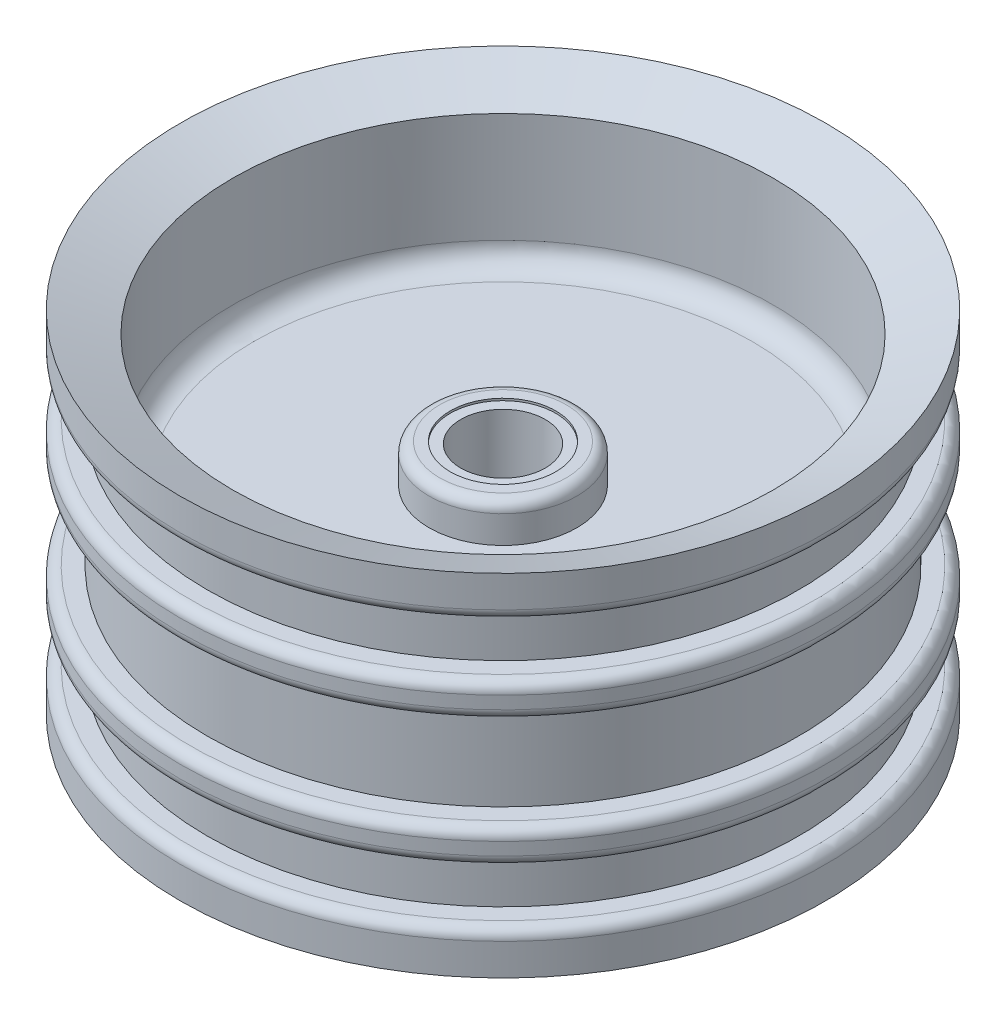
ISO-10303-21;
HEADER;
FILE_DESCRIPTION(('STEP AP214'),'2;1');
FILE_NAME('part.step','',(''),(''),'','','');
FILE_SCHEMA(('AUTOMOTIVE_DESIGN { 1 0 10303 214 1 1 1 1 }'));
ENDSEC;
DATA;
#1=APPLICATION_CONTEXT('core data for automotive mechanical design processes');
#2=APPLICATION_PROTOCOL_DEFINITION('international standard','automotive_design',2000,#1);
#3=PRODUCT_CONTEXT('',#1,'mechanical');
#4=PRODUCT('Part','Part','',(#3));
#5=PRODUCT_RELATED_PRODUCT_CATEGORY('part','',(#4));
#6=PRODUCT_DEFINITION_FORMATION('','',#4);
#7=PRODUCT_DEFINITION_CONTEXT('part definition',#1,'design');
#8=PRODUCT_DEFINITION('design','',#6,#7);
#9=PRODUCT_DEFINITION_SHAPE('','',#8);
#10=(LENGTH_UNIT() NAMED_UNIT(*) SI_UNIT(.MILLI.,.METRE.));
#11=(NAMED_UNIT(*) PLANE_ANGLE_UNIT() SI_UNIT($,.RADIAN.));
#12=(NAMED_UNIT(*) SI_UNIT($,.STERADIAN.) SOLID_ANGLE_UNIT());
#13=UNCERTAINTY_MEASURE_WITH_UNIT(LENGTH_MEASURE(1.E-05),#10,'distance_accuracy_value','');
#14=(GEOMETRIC_REPRESENTATION_CONTEXT(3) GLOBAL_UNCERTAINTY_ASSIGNED_CONTEXT((#13)) GLOBAL_UNIT_ASSIGNED_CONTEXT((#10,
#11,#12)) REPRESENTATION_CONTEXT('',''));
#15=CARTESIAN_POINT('',(0.,0.,0.));
#16=DIRECTION('',(0.,0.,1.));
#17=DIRECTION('',(1.,0.,0.));
#18=AXIS2_PLACEMENT_3D('',#15,#16,#17);
#19=CARTESIAN_POINT('',(0.,7.8,0.));
#20=DIRECTION('',(0.,-1.,0.));
#21=DIRECTION('',(0.,0.,-1.));
#22=AXIS2_PLACEMENT_3D('',#19,#20,#21);
#23=PLANE('',#22);
#24=CARTESIAN_POINT('',(0.,7.8,0.));
#25=DIRECTION('',(0.,-1.,0.));
#26=DIRECTION('',(0.,0.,-1.));
#27=AXIS2_PLACEMENT_3D('',#24,#25,#26);
#28=CIRCLE('',#27,11.8);
#29=CARTESIAN_POINT('',(0.,7.8,-11.8));
#30=VERTEX_POINT('',#29);
#31=EDGE_CURVE('E193',#30,#30,#28,.T.);
#32=ORIENTED_EDGE('',*,*,#31,.T.);
#33=EDGE_LOOP('',(#32));
#34=FACE_BOUND('',#33,.T.);
#35=CARTESIAN_POINT('',(0.,7.8,0.));
#36=DIRECTION('',(0.,-1.,0.));
#37=DIRECTION('',(0.,0.,-1.));
#38=AXIS2_PLACEMENT_3D('',#35,#36,#37);
#39=CIRCLE('',#38,2.);
#40=CARTESIAN_POINT('',(1.93649167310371,7.8,-0.5));
#41=VERTEX_POINT('',#40);
#42=CARTESIAN_POINT('',(1.93649167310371,7.8,0.5));
#43=VERTEX_POINT('',#42);
#44=EDGE_CURVE('E207',#41,#43,#39,.T.);
#45=ORIENTED_EDGE('',*,*,#44,.F.);
#46=DIRECTION('',(1.,0.,0.));
#47=VECTOR('',#46,1.);
#48=CARTESIAN_POINT('',(7.,7.8,-0.5));
#49=LINE('',#48,#47);
#50=CARTESIAN_POINT('',(4.9749371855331,7.8,-0.5));
#51=VERTEX_POINT('',#50);
#52=EDGE_CURVE('E383',#41,#51,#49,.T.);
#53=ORIENTED_EDGE('',*,*,#52,.T.);
#54=CARTESIAN_POINT('',(0.,7.8,0.));
#55=DIRECTION('',(0.,-1.,0.));
#56=DIRECTION('',(0.,0.,-1.));
#57=AXIS2_PLACEMENT_3D('',#54,#55,#56);
#58=CIRCLE('',#57,5.);
#59=CARTESIAN_POINT('',(-4.9749371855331,7.8,-0.500000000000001));
#60=VERTEX_POINT('',#59);
#61=EDGE_CURVE('E392',#60,#51,#58,.T.);
#62=ORIENTED_EDGE('',*,*,#61,.F.);
#63=CARTESIAN_POINT('',(-1.93649167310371,7.8,-0.5));
#64=VERTEX_POINT('',#63);
#65=EDGE_CURVE('E264',#60,#64,#49,.T.);
#66=ORIENTED_EDGE('',*,*,#65,.T.);
#67=CARTESIAN_POINT('',(-1.93649167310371,7.8,0.5));
#68=VERTEX_POINT('',#67);
#69=EDGE_CURVE('E206',#68,#64,#39,.T.);
#70=ORIENTED_EDGE('',*,*,#69,.F.);
#71=DIRECTION('',(-1.,0.,0.));
#72=VECTOR('',#71,1.);
#73=CARTESIAN_POINT('',(7.,7.8,0.500000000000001));
#74=LINE('',#73,#72);
#75=CARTESIAN_POINT('',(-4.9749371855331,7.8,0.5));
#76=VERTEX_POINT('',#75);
#77=EDGE_CURVE('E260',#68,#76,#74,.T.);
#78=ORIENTED_EDGE('',*,*,#77,.T.);
#79=CARTESIAN_POINT('',(4.9749371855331,7.8,0.5));
#80=VERTEX_POINT('',#79);
#81=EDGE_CURVE('E399',#80,#76,#58,.T.);
#82=ORIENTED_EDGE('',*,*,#81,.F.);
#83=EDGE_CURVE('E381',#80,#43,#74,.T.);
#84=ORIENTED_EDGE('',*,*,#83,.T.);
#85=EDGE_LOOP('',(#45,#53,#62,#66,#70,#78,#82,#84));
#86=FACE_BOUND('',#85,.T.);
#87=ADVANCED_FACE('F38',(#34,#86),#23,.T.);
#88=CARTESIAN_POINT('',(0.486486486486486,7.8,1.93993064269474));
#89=VERTEX_POINT('',#88);
#90=CARTESIAN_POINT('',(-0.5,7.8,1.93649167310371));
#91=VERTEX_POINT('',#90);
#92=EDGE_CURVE('E188',#89,#91,#39,.T.);
#93=ORIENTED_EDGE('',*,*,#92,.F.);
#94=DIRECTION('',(0.,0.,1.));
#95=VECTOR('',#94,1.);
#96=CARTESIAN_POINT('',(0.486486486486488,7.8,-3.5669778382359));
#97=LINE('',#96,#95);
#98=CARTESIAN_POINT('',(0.486486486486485,7.8,3.5669778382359));
#99=VERTEX_POINT('',#98);
#100=EDGE_CURVE('E200',#89,#99,#97,.T.);
#101=ORIENTED_EDGE('',*,*,#100,.T.);
#102=CARTESIAN_POINT('',(0.,7.8,0.));
#103=DIRECTION('',(0.,-1.,0.));
#104=DIRECTION('',(0.,0.,-1.));
#105=AXIS2_PLACEMENT_3D('',#102,#103,#104);
#106=CIRCLE('',#105,3.6);
#107=CARTESIAN_POINT('',(-0.499999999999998,7.8,3.56510869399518));
#108=VERTEX_POINT('',#107);
#109=EDGE_CURVE('E216',#99,#108,#106,.T.);
#110=ORIENTED_EDGE('',*,*,#109,.T.);
#111=DIRECTION('',(0.,0.,-1.));
#112=VECTOR('',#111,1.);
#113=CARTESIAN_POINT('',(-0.5,7.8,-3.56510869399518));
#114=LINE('',#113,#112);
#115=EDGE_CURVE('E203',#108,#91,#114,.T.);
#116=ORIENTED_EDGE('',*,*,#115,.T.);
#117=EDGE_LOOP('',(#93,#101,#110,#116));
#118=FACE_BOUND('',#117,.T.);
#119=ADVANCED_FACE('F198',(#118),#23,.T.);
#120=CARTESIAN_POINT('',(0.,-4.7,0.));
#121=DIRECTION('',(0.,-1.,0.));
#122=DIRECTION('',(0.,0.,-1.));
#123=AXIS2_PLACEMENT_3D('',#120,#121,#122);
#124=PLANE('',#123);
#125=CARTESIAN_POINT('',(0.,-4.7,0.));
#126=DIRECTION('',(0.,-1.,0.));
#127=DIRECTION('',(0.,0.,-1.));
#128=AXIS2_PLACEMENT_3D('',#125,#126,#127);
#129=CIRCLE('',#128,2.);
#130=CARTESIAN_POINT('',(-0.5,-4.7,1.93649167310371));
#131=VERTEX_POINT('',#130);
#132=CARTESIAN_POINT('',(-1.93649167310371,-4.7,0.5));
#133=VERTEX_POINT('',#132);
#134=EDGE_CURVE('E557',#131,#133,#129,.T.);
#135=ORIENTED_EDGE('',*,*,#134,.F.);
#136=DIRECTION('',(0.,0.,-1.));
#137=VECTOR('',#136,1.);
#138=CARTESIAN_POINT('',(-0.5,-4.7,-3.56510869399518));
#139=LINE('',#138,#137);
#140=CARTESIAN_POINT('',(-0.5,-4.7,3.46410161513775));
#141=VERTEX_POINT('',#140);
#142=EDGE_CURVE('E218',#141,#131,#139,.T.);
#143=ORIENTED_EDGE('',*,*,#142,.F.);
#144=CARTESIAN_POINT('',(0.,-4.7,0.));
#145=DIRECTION('',(0.,-1.,0.));
#146=DIRECTION('',(0.,0.,-1.));
#147=AXIS2_PLACEMENT_3D('',#144,#145,#146);
#148=CIRCLE('',#147,3.5);
#149=CARTESIAN_POINT('',(-3.46410161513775,-4.7,0.5));
#150=VERTEX_POINT('',#149);
#151=EDGE_CURVE('E239',#141,#150,#148,.T.);
#152=ORIENTED_EDGE('',*,*,#151,.T.);
#153=DIRECTION('',(-1.,0.,0.));
#154=VECTOR('',#153,1.);
#155=CARTESIAN_POINT('',(7.,-4.7,0.500000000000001));
#156=LINE('',#155,#154);
#157=EDGE_CURVE('E249',#133,#150,#156,.T.);
#158=ORIENTED_EDGE('',*,*,#157,.F.);
#159=EDGE_LOOP('',(#135,#143,#152,#158));
#160=FACE_BOUND('',#159,.T.);
#161=ADVANCED_FACE('F556',(#160),#124,.T.);
#162=CARTESIAN_POINT('',(0.,-4.7,0.));
#163=DIRECTION('',(0.,-1.,0.));
#164=DIRECTION('',(0.,0.,-1.));
#165=AXIS2_PLACEMENT_3D('',#162,#163,#164);
#166=CIRCLE('',#165,2.);
#167=CARTESIAN_POINT('',(-1.93649167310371,-4.7,-0.5));
#168=VERTEX_POINT('',#167);
#169=CARTESIAN_POINT('',(-0.5,-4.7,-1.93649167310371));
#170=VERTEX_POINT('',#169);
#171=EDGE_CURVE('E577',#168,#170,#166,.T.);
#172=ORIENTED_EDGE('',*,*,#171,.F.);
#173=DIRECTION('',(1.,0.,0.));
#174=VECTOR('',#173,1.);
#175=CARTESIAN_POINT('',(7.,-4.7,-0.5));
#176=LINE('',#175,#174);
#177=CARTESIAN_POINT('',(-3.46410161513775,-4.7,-0.5));
#178=VERTEX_POINT('',#177);
#179=EDGE_CURVE('E247',#178,#168,#176,.T.);
#180=ORIENTED_EDGE('',*,*,#179,.F.);
#181=CARTESIAN_POINT('',(-0.5,-4.7,-3.46410161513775));
#182=VERTEX_POINT('',#181);
#183=EDGE_CURVE('E498',#178,#182,#148,.T.);
#184=ORIENTED_EDGE('',*,*,#183,.T.);
#185=EDGE_CURVE('E243',#170,#182,#139,.T.);
#186=ORIENTED_EDGE('',*,*,#185,.F.);
#187=EDGE_LOOP('',(#172,#180,#184,#186));
#188=FACE_BOUND('',#187,.T.);
#189=ADVANCED_FACE('F582',(#188),#124,.T.);
#190=CARTESIAN_POINT('',(7.,7.8,0.500000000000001));
#191=DIRECTION('',(0.,0.,1.));
#192=DIRECTION('',(1.,0.,0.));
#193=AXIS2_PLACEMENT_3D('',#190,#191,#192);
#194=PLANE('',#193);
#195=ORIENTED_EDGE('',*,*,#77,.F.);
#196=DIRECTION('',(0.,1.,0.));
#197=VECTOR('',#196,1.);
#198=CARTESIAN_POINT('',(-1.93649167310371,-4.70011146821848,0.5));
#199=LINE('',#198,#197);
#200=EDGE_CURVE('E569',#68,#133,#199,.F.);
#201=ORIENTED_EDGE('',*,*,#200,.T.);
#202=ORIENTED_EDGE('',*,*,#157,.T.);
#203=CARTESIAN_POINT('',(-2.68116245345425,-9.85076280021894,0.5));
#204=CARTESIAN_POINT('',(-2.91993938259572,-8.28549185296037,0.5));
#205=CARTESIAN_POINT('',(-3.15783133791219,-6.72008636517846,0.5));
#206=CARTESIAN_POINT('',(-3.47784494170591,-4.60945995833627,0.5));
#207=CARTESIAN_POINT('',(-3.56043461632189,-4.06431002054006,0.5));
#208=CARTESIAN_POINT('',(-3.80276011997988,-2.4638059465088,0.5));
#209=CARTESIAN_POINT('',(-3.96235938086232,-1.40843113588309,0.5));
#210=CARTESIAN_POINT('',(-4.28129841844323,0.702357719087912,0.5));
#211=CARTESIAN_POINT('',(-4.44063819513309,1.75777176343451,0.5));
#212=CARTESIAN_POINT('',(-4.84011137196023,4.40532706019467,0.5));
#213=CARTESIAN_POINT('',(-5.08012640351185,5.9974861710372,0.5));
#214=CARTESIAN_POINT('',(-5.55988421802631,9.18184542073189,0.5));
#215=CARTESIAN_POINT('',(-5.79962700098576,10.7740455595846,0.5));
#216=CARTESIAN_POINT('',(-6.2789258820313,13.9584736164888,0.5));
#217=CARTESIAN_POINT('',(-6.51848198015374,15.5507015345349,0.5));
#218=CARTESIAN_POINT('',(-6.99745706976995,18.7351779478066,0.5));
#219=CARTESIAN_POINT('',(-7.23687606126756,20.3274264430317,0.5));
#220=CARTESIAN_POINT('',(-7.47625127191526,21.9196815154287,0.5));
#221=B_SPLINE_CURVE_WITH_KNOTS('',3,(#203,#204,#205,#206,#207,#208,#209,#210,#211,#212,#213,
#214,#215,#216,#217,#218,#219,#220),.UNSPECIFIED.,.F.,.F.,(4,2,2,2,2,2,2,2,4),(0.,
4.75013477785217,6.40424648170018,9.60636935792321,12.8084923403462,17.6389374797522,
22.4693826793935,27.2998269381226,32.1302710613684),.UNSPECIFIED.);
#222=CARTESIAN_POINT('',(-4.22048575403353,0.3,0.5));
#223=VERTEX_POINT('',#222);
#224=EDGE_CURVE('E505',#150,#223,#221,.T.);
#225=ORIENTED_EDGE('',*,*,#224,.T.);
#226=DIRECTION('',(-1.,0.,0.));
#227=VECTOR('',#226,1.);
#228=CARTESIAN_POINT('',(0.,0.3,0.5));
#229=LINE('',#228,#227);
#230=CARTESIAN_POINT('',(-4.9749371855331,0.3,0.5));
#231=VERTEX_POINT('',#230);
#232=EDGE_CURVE('E274',#223,#231,#229,.T.);
#233=ORIENTED_EDGE('',*,*,#232,.T.);
#234=DIRECTION('',(0.,1.,0.));
#235=VECTOR('',#234,1.);
#236=CARTESIAN_POINT('',(-4.9749371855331,0.3,0.5));
#237=LINE('',#236,#235);
#238=EDGE_CURVE('E277',#76,#231,#237,.F.);
#239=ORIENTED_EDGE('',*,*,#238,.F.);
#240=EDGE_LOOP('',(#195,#201,#202,#225,#233,#239));
#241=FACE_BOUND('',#240,.T.);
#242=ADVANCED_FACE('F597',(#241),#194,.F.);
#243=CARTESIAN_POINT('',(7.,7.8,-0.5));
#244=DIRECTION('',(0.,0.,-1.));
#245=DIRECTION('',(-1.,0.,0.));
#246=AXIS2_PLACEMENT_3D('',#243,#244,#245);
#247=PLANE('',#246);
#248=ORIENTED_EDGE('',*,*,#179,.T.);
#249=DIRECTION('',(0.,1.,0.));
#250=VECTOR('',#249,1.);
#251=CARTESIAN_POINT('',(-1.93649167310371,-4.70011146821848,-0.5));
#252=LINE('',#251,#250);
#253=EDGE_CURVE('E574',#168,#64,#252,.T.);
#254=ORIENTED_EDGE('',*,*,#253,.T.);
#255=ORIENTED_EDGE('',*,*,#65,.F.);
#256=DIRECTION('',(0.,1.,0.));
#257=VECTOR('',#256,1.);
#258=CARTESIAN_POINT('',(-4.9749371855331,0.3,-0.500000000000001));
#259=LINE('',#258,#257);
#260=CARTESIAN_POINT('',(-4.9749371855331,0.3,-0.500000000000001));
#261=VERTEX_POINT('',#260);
#262=EDGE_CURVE('E268',#261,#60,#259,.T.);
#263=ORIENTED_EDGE('',*,*,#262,.F.);
#264=DIRECTION('',(1.,0.,0.));
#265=VECTOR('',#264,1.);
#266=CARTESIAN_POINT('',(0.,0.3,-0.5));
#267=LINE('',#266,#265);
#268=CARTESIAN_POINT('',(-4.22048575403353,0.3,-0.5));
#269=VERTEX_POINT('',#268);
#270=EDGE_CURVE('E265',#261,#269,#267,.T.);
#271=ORIENTED_EDGE('',*,*,#270,.T.);
#272=CARTESIAN_POINT('',(-2.68116245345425,-9.85076280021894,-0.5));
#273=CARTESIAN_POINT('',(-2.91993938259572,-8.28549185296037,-0.5));
#274=CARTESIAN_POINT('',(-3.15783133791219,-6.72008636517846,-0.5));
#275=CARTESIAN_POINT('',(-3.47784494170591,-4.60945995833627,-0.5));
#276=CARTESIAN_POINT('',(-3.56043461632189,-4.06431002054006,-0.5));
#277=CARTESIAN_POINT('',(-3.80276011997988,-2.4638059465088,-0.5));
#278=CARTESIAN_POINT('',(-3.96235938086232,-1.40843113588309,-0.5));
#279=CARTESIAN_POINT('',(-4.28129841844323,0.702357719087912,-0.5));
#280=CARTESIAN_POINT('',(-4.44063819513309,1.75777176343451,-0.5));
#281=CARTESIAN_POINT('',(-4.84011137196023,4.40532706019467,-0.5));
#282=CARTESIAN_POINT('',(-5.08012640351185,5.9974861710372,-0.500000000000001));
#283=CARTESIAN_POINT('',(-5.55988421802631,9.18184542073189,-0.500000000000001));
#284=CARTESIAN_POINT('',(-5.79962700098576,10.7740455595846,-0.500000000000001));
#285=CARTESIAN_POINT('',(-6.2789258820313,13.9584736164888,-0.500000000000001));
#286=CARTESIAN_POINT('',(-6.51848198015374,15.5507015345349,-0.500000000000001));
#287=CARTESIAN_POINT('',(-6.99745706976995,18.7351779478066,-0.500000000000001));
#288=CARTESIAN_POINT('',(-7.23687606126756,20.3274264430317,-0.500000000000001));
#289=CARTESIAN_POINT('',(-7.47625127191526,21.9196815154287,-0.500000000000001));
#290=B_SPLINE_CURVE_WITH_KNOTS('',3,(#272,#273,#274,#275,#276,#277,#278,#279,#280,#281,#282,
#283,#284,#285,#286,#287,#288,#289),.UNSPECIFIED.,.F.,.F.,(4,2,2,2,2,2,2,2,4),(0.,
4.75013477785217,6.40424648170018,9.60636935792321,12.8084923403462,17.6389374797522,
22.4693826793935,27.2998269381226,32.1302710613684),.UNSPECIFIED.);
#291=EDGE_CURVE('E501',#269,#178,#290,.F.);
#292=ORIENTED_EDGE('',*,*,#291,.T.);
#293=EDGE_LOOP('',(#248,#254,#255,#263,#271,#292));
#294=FACE_BOUND('',#293,.T.);
#295=ADVANCED_FACE('F583',(#294),#247,.F.);
#296=CARTESIAN_POINT('',(0.,0.3,0.));
#297=DIRECTION('',(0.,-1.,0.));
#298=DIRECTION('',(0.,0.,-1.));
#299=AXIS2_PLACEMENT_3D('',#296,#297,#298);
#300=PLANE('',#299);
#301=CARTESIAN_POINT('',(4.9749371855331,0.3,0.5));
#302=VERTEX_POINT('',#301);
#303=CARTESIAN_POINT('',(4.22048575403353,0.3,0.5));
#304=VERTEX_POINT('',#303);
#305=EDGE_CURVE('E271',#302,#304,#229,.T.);
#306=ORIENTED_EDGE('',*,*,#305,.F.);
#307=CARTESIAN_POINT('',(0.,0.3,0.));
#308=DIRECTION('',(0.,-1.,0.));
#309=DIRECTION('',(0.,0.,-1.));
#310=AXIS2_PLACEMENT_3D('',#307,#308,#309);
#311=CIRCLE('',#310,5.);
#312=EDGE_CURVE('E415',#302,#231,#311,.T.);
#313=ORIENTED_EDGE('',*,*,#312,.T.);
#314=ORIENTED_EDGE('',*,*,#232,.F.);
#315=CARTESIAN_POINT('',(0.,0.3,0.));
#316=DIRECTION('',(0.,-1.,0.));
#317=DIRECTION('',(0.,0.,-1.));
#318=AXIS2_PLACEMENT_3D('',#315,#316,#317);
#319=CIRCLE('',#318,4.25);
#320=EDGE_CURVE('E536',#304,#223,#319,.T.);
#321=ORIENTED_EDGE('',*,*,#320,.F.);
#322=EDGE_LOOP('',(#306,#313,#314,#321));
#323=FACE_BOUND('',#322,.T.);
#324=ADVANCED_FACE('F596',(#323),#300,.T.);
#325=CARTESIAN_POINT('',(0.,0.3,0.));
#326=DIRECTION('',(0.,1.,0.));
#327=DIRECTION('',(0.,0.,1.));
#328=AXIS2_PLACEMENT_3D('',#325,#326,#327);
#329=CYLINDRICAL_SURFACE('',#328,5.);
#330=ORIENTED_EDGE('',*,*,#312,.F.);
#331=DIRECTION('',(0.,1.,0.));
#332=VECTOR('',#331,1.);
#333=CARTESIAN_POINT('',(4.9749371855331,0.3,0.5));
#334=LINE('',#333,#332);
#335=EDGE_CURVE('E273',#302,#80,#334,.T.);
#336=ORIENTED_EDGE('',*,*,#335,.T.);
#337=ORIENTED_EDGE('',*,*,#81,.T.);
#338=ORIENTED_EDGE('',*,*,#238,.T.);
#339=EDGE_LOOP('',(#330,#336,#337,#338));
#340=FACE_BOUND('',#339,.T.);
#341=ADVANCED_FACE('F592',(#340),#329,.T.);
#342=CARTESIAN_POINT('',(0.,-4.7,0.));
#343=DIRECTION('',(0.,-1.,0.));
#344=DIRECTION('',(0.,0.,-1.));
#345=AXIS2_PLACEMENT_3D('',#342,#343,#344);
#346=CIRCLE('',#345,2.);
#347=CARTESIAN_POINT('',(1.93649167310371,-4.7,0.5));
#348=VERTEX_POINT('',#347);
#349=CARTESIAN_POINT('',(0.486486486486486,-4.7,1.93993064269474));
#350=VERTEX_POINT('',#349);
#351=EDGE_CURVE('E53',#348,#350,#346,.T.);
#352=ORIENTED_EDGE('',*,*,#351,.F.);
#353=CARTESIAN_POINT('',(3.46410161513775,-4.7,0.5));
#354=VERTEX_POINT('',#353);
#355=EDGE_CURVE('E248',#354,#348,#156,.T.);
#356=ORIENTED_EDGE('',*,*,#355,.F.);
#357=CARTESIAN_POINT('',(0.486486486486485,-4.7,3.4660252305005));
#358=VERTEX_POINT('',#357);
#359=EDGE_CURVE('E400',#354,#358,#148,.T.);
#360=ORIENTED_EDGE('',*,*,#359,.T.);
#361=DIRECTION('',(0.,0.,1.));
#362=VECTOR('',#361,1.);
#363=CARTESIAN_POINT('',(0.486486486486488,-4.7,-3.5669778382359));
#364=LINE('',#363,#362);
#365=EDGE_CURVE('E236',#350,#358,#364,.T.);
#366=ORIENTED_EDGE('',*,*,#365,.F.);
#367=EDGE_LOOP('',(#352,#356,#360,#366));
#368=FACE_BOUND('',#367,.T.);
#369=ADVANCED_FACE('F603',(#368),#124,.T.);
#370=CARTESIAN_POINT('',(0.,-4.7,0.));
#371=DIRECTION('',(0.,1.,0.));
#372=DIRECTION('',(0.,0.,1.));
#373=AXIS2_PLACEMENT_3D('',#370,#371,#372);
#374=CONICAL_SURFACE('',#373,3.5,0.148889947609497);
#375=CARTESIAN_POINT('',(-0.5,-10.3468781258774,2.60542524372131));
#376=CARTESIAN_POINT('',(-0.5,-8.82434967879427,2.83790860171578));
#377=CARTESIAN_POINT('',(-0.5,-7.30168241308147,3.06947955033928));
#378=CARTESIAN_POINT('',(-0.5,-5.24868514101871,3.38094784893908));
#379=CARTESIAN_POINT('',(-0.5,-4.71842827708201,3.46132716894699));
#380=CARTESIAN_POINT('',(-0.5,-3.16163062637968,3.69716173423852));
#381=CARTESIAN_POINT('',(-0.5,-2.13506855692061,3.85247646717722));
#382=CARTESIAN_POINT('',(-0.5,-0.0819038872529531,4.16283795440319));
#383=CARTESIAN_POINT('',(-0.5,0.944698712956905,4.31788470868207));
#384=CARTESIAN_POINT('',(-0.5,3.85695533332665,4.75744761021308));
#385=CARTESIAN_POINT('',(-0.5,5.7426429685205,5.04174100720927));
#386=CARTESIAN_POINT('',(-0.5,9.51407808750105,5.60992913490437));
#387=CARTESIAN_POINT('',(-0.5,11.3998255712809,5.893823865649));
#388=CARTESIAN_POINT('',(-0.5,13.2855853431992,6.17763655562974));
#389=B_SPLINE_CURVE_WITH_KNOTS('',3,(#375,#376,#377,#378,#379,#380,#381,#382,#383,#384,#385,
#386,#387,#388),.UNSPECIFIED.,.F.,.F.,(4,2,2,2,2,2,4),(0.,4.62052641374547,6.22946971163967,
9.34420417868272,12.4589387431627,18.1799320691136,23.9009247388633),.UNSPECIFIED.);
#390=CARTESIAN_POINT('',(-0.499999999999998,-4.03333333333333,3.56510869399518));
#391=VERTEX_POINT('',#390);
#392=EDGE_CURVE('E365',#391,#141,#389,.F.);
#393=ORIENTED_EDGE('',*,*,#392,.F.);
#394=CARTESIAN_POINT('',(0.,-4.03333333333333,0.));
#395=DIRECTION('',(0.,1.,0.));
#396=DIRECTION('',(0.,0.,1.));
#397=AXIS2_PLACEMENT_3D('',#394,#395,#396);
#398=CIRCLE('',#397,3.6);
#399=CARTESIAN_POINT('',(0.486486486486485,-4.03333333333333,3.5669778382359));
#400=VERTEX_POINT('',#399);
#401=EDGE_CURVE('E194',#400,#391,#398,.F.);
#402=ORIENTED_EDGE('',*,*,#401,.F.);
#403=CARTESIAN_POINT('',(0.486486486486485,-10.3469634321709,2.60796926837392));
#404=CARTESIAN_POINT('',(0.486486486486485,-8.82440893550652,2.84023232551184));
#405=CARTESIAN_POINT('',(0.486486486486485,-7.3017234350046,3.07163367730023));
#406=CARTESIAN_POINT('',(0.486486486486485,-5.2486961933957,3.38291583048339));
#407=CARTESIAN_POINT('',(0.486486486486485,-4.71842352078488,3.46325204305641));
#408=CARTESIAN_POINT('',(0.486486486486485,-3.16159740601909,3.69896573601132));
#409=CARTESIAN_POINT('',(0.486486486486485,-2.13502385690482,3.85421039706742));
#410=CARTESIAN_POINT('',(0.486486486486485,-0.0818384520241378,4.1644463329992));
#411=CARTESIAN_POINT('',(0.486486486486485,0.944773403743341,4.31943760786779));
#412=CARTESIAN_POINT('',(0.486486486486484,3.85724271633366,4.75888602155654));
#413=CARTESIAN_POINT('',(0.486486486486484,5.74313196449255,5.04313242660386));
#414=CARTESIAN_POINT('',(0.486486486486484,9.51496708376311,5.61124804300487));
#415=CARTESIAN_POINT('',(0.486486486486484,11.4009129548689,5.89511725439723));
#416=CARTESIAN_POINT('',(0.486486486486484,13.286870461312,6.178908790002));
#417=B_SPLINE_CURVE_WITH_KNOTS('',3,(#403,#404,#405,#406,#407,#408,#409,#410,#411,#412,#413,
#414,#415,#416),.UNSPECIFIED.,.F.,.F.,(4,2,2,2,2,2,4),(0.,4.62050404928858,6.22947486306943,
9.34421194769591,12.4589491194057,18.1805195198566,23.9020893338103),.UNSPECIFIED.);
#418=EDGE_CURVE('E547',#358,#400,#417,.T.);
#419=ORIENTED_EDGE('',*,*,#418,.F.);
#420=ORIENTED_EDGE('',*,*,#359,.F.);
#421=CARTESIAN_POINT('',(2.68116245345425,-9.85076280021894,0.5));
#422=CARTESIAN_POINT('',(2.91993938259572,-8.28549185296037,0.5));
#423=CARTESIAN_POINT('',(3.15783133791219,-6.72008636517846,0.5));
#424=CARTESIAN_POINT('',(3.47784494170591,-4.60945995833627,0.5));
#425=CARTESIAN_POINT('',(3.56043461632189,-4.06431002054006,0.5));
#426=CARTESIAN_POINT('',(3.80276011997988,-2.4638059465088,0.5));
#427=CARTESIAN_POINT('',(3.96235938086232,-1.40843113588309,0.5));
#428=CARTESIAN_POINT('',(4.28129841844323,0.702357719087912,0.5));
#429=CARTESIAN_POINT('',(4.44063819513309,1.75777176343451,0.5));
#430=CARTESIAN_POINT('',(4.84011137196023,4.40532706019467,0.5));
#431=CARTESIAN_POINT('',(5.08012640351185,5.9974861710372,0.5));
#432=CARTESIAN_POINT('',(5.55988421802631,9.18184542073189,0.5));
#433=CARTESIAN_POINT('',(5.79962700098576,10.7740455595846,0.5));
#434=CARTESIAN_POINT('',(6.2789258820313,13.9584736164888,0.5));
#435=CARTESIAN_POINT('',(6.51848198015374,15.5507015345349,0.500000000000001));
#436=CARTESIAN_POINT('',(6.99745706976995,18.7351779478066,0.500000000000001));
#437=CARTESIAN_POINT('',(7.23687606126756,20.3274264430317,0.500000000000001));
#438=CARTESIAN_POINT('',(7.47625127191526,21.9196815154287,0.500000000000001));
#439=B_SPLINE_CURVE_WITH_KNOTS('',3,(#421,#422,#423,#424,#425,#426,#427,#428,#429,#430,#431,
#432,#433,#434,#435,#436,#437,#438),.UNSPECIFIED.,.F.,.F.,(4,2,2,2,2,2,2,2,4),(0.,
4.75013477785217,6.40424648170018,9.60636935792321,12.8084923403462,17.6389374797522,
22.4693826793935,27.2998269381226,32.1302710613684),.UNSPECIFIED.);
#440=EDGE_CURVE('E503',#304,#354,#439,.F.);
#441=ORIENTED_EDGE('',*,*,#440,.F.);
#442=ORIENTED_EDGE('',*,*,#320,.T.);
#443=ORIENTED_EDGE('',*,*,#224,.F.);
#444=ORIENTED_EDGE('',*,*,#151,.F.);
#445=EDGE_LOOP('',(#393,#402,#419,#420,#441,#442,#443,#444));
#446=FACE_BOUND('',#445,.T.);
#447=ADVANCED_FACE('F303',(#446),#374,.T.);
#448=ORIENTED_EDGE('',*,*,#270,.F.);
#449=CARTESIAN_POINT('',(4.9749371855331,0.3,-0.5));
#450=VERTEX_POINT('',#449);
#451=EDGE_CURVE('E403',#261,#450,#311,.T.);
#452=ORIENTED_EDGE('',*,*,#451,.T.);
#453=CARTESIAN_POINT('',(4.22048575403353,0.3,-0.5));
#454=VERTEX_POINT('',#453);
#455=EDGE_CURVE('E261',#454,#450,#267,.T.);
#456=ORIENTED_EDGE('',*,*,#455,.F.);
#457=EDGE_CURVE('E280',#269,#454,#319,.T.);
#458=ORIENTED_EDGE('',*,*,#457,.F.);
#459=EDGE_LOOP('',(#448,#452,#456,#458));
#460=FACE_BOUND('',#459,.T.);
#461=ADVANCED_FACE('F306',(#460),#300,.T.);
#462=CARTESIAN_POINT('',(-0.5,7.8,-1.93649167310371));
#463=VERTEX_POINT('',#462);
#464=CARTESIAN_POINT('',(0.486486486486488,7.8,-1.93993064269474));
#465=VERTEX_POINT('',#464);
#466=EDGE_CURVE('E564',#463,#465,#39,.T.);
#467=ORIENTED_EDGE('',*,*,#466,.F.);
#468=CARTESIAN_POINT('',(-0.5,7.8,-3.56510869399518));
#469=VERTEX_POINT('',#468);
#470=EDGE_CURVE('E223',#463,#469,#114,.T.);
#471=ORIENTED_EDGE('',*,*,#470,.T.);
#472=CARTESIAN_POINT('',(0.,7.8,0.));
#473=DIRECTION('',(0.,-1.,0.));
#474=DIRECTION('',(0.,0.,-1.));
#475=AXIS2_PLACEMENT_3D('',#472,#473,#474);
#476=CIRCLE('',#475,3.6);
#477=CARTESIAN_POINT('',(0.486486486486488,7.8,-3.5669778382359));
#478=VERTEX_POINT('',#477);
#479=EDGE_CURVE('E213',#469,#478,#476,.T.);
#480=ORIENTED_EDGE('',*,*,#479,.T.);
#481=EDGE_CURVE('E212',#478,#465,#97,.T.);
#482=ORIENTED_EDGE('',*,*,#481,.T.);
#483=EDGE_LOOP('',(#467,#471,#480,#482));
#484=FACE_BOUND('',#483,.T.);
#485=ADVANCED_FACE('F609',(#484),#23,.T.);
#486=CARTESIAN_POINT('',(0.,9.4,0.));
#487=DIRECTION('',(0.,1.,0.));
#488=DIRECTION('',(0.,0.,1.));
#489=AXIS2_PLACEMENT_3D('',#486,#487,#488);
#490=PLANE('',#489);
#491=CARTESIAN_POINT('',(0.,9.4,0.));
#492=DIRECTION('',(0.,1.,0.));
#493=DIRECTION('',(0.,0.,1.));
#494=AXIS2_PLACEMENT_3D('',#491,#492,#493);
#495=CIRCLE('',#494,11.8);
#496=CARTESIAN_POINT('',(0.,9.4,11.8));
#497=VERTEX_POINT('',#496);
#498=EDGE_CURVE('E774',#497,#497,#495,.T.);
#499=ORIENTED_EDGE('',*,*,#498,.T.);
#500=EDGE_LOOP('',(#499));
#501=FACE_BOUND('',#500,.T.);
#502=CARTESIAN_POINT('',(0.,9.4,0.));
#503=DIRECTION('',(0.,1.,0.));
#504=DIRECTION('',(0.,0.,1.));
#505=AXIS2_PLACEMENT_3D('',#502,#503,#504);
#506=CIRCLE('',#505,3.5);
#507=CARTESIAN_POINT('',(0.,9.4,3.5));
#508=VERTEX_POINT('',#507);
#509=EDGE_CURVE('E411',#508,#508,#506,.T.);
#510=ORIENTED_EDGE('',*,*,#509,.F.);
#511=EDGE_LOOP('',(#510));
#512=FACE_BOUND('',#511,.T.);
#513=ADVANCED_FACE('F617',(#501,#512),#490,.T.);
#514=CARTESIAN_POINT('',(0.,16.6,0.));
#515=DIRECTION('',(0.,-1.,0.));
#516=DIRECTION('',(0.,0.,-1.));
#517=AXIS2_PLACEMENT_3D('',#514,#515,#516);
#518=CYLINDRICAL_SURFACE('',#517,14.);
#519=CARTESIAN_POINT('',(0.,10.5,0.));
#520=DIRECTION('',(0.,-1.,0.));
#521=DIRECTION('',(0.,0.,-1.));
#522=AXIS2_PLACEMENT_3D('',#519,#520,#521);
#523=CIRCLE('',#522,14.);
#524=CARTESIAN_POINT('',(0.,10.5,-14.));
#525=VERTEX_POINT('',#524);
#526=EDGE_CURVE('E442',#525,#525,#523,.T.);
#527=CARTESIAN_POINT('',(0.,6.1,0.));
#528=DIRECTION('',(0.,-1.,0.));
#529=DIRECTION('',(0.,0.,-1.));
#530=AXIS2_PLACEMENT_3D('',#527,#528,#529);
#531=CIRCLE('',#530,14.);
#532=CARTESIAN_POINT('',(0.,6.1,-14.));
#533=VERTEX_POINT('',#532);
#534=EDGE_CURVE('E472',#533,#533,#531,.T.);
#535=CARTESIAN_POINT('',(0.,10.5,-14.));
#536=CARTESIAN_POINT('',(0.,10.4541666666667,-14.));
#537=CARTESIAN_POINT('',(0.,10.4083333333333,-14.));
#538=CARTESIAN_POINT('',(0.,10.3166666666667,-14.));
#539=CARTESIAN_POINT('',(0.,10.2708333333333,-14.));
#540=CARTESIAN_POINT('',(0.,10.1791666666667,-14.));
#541=CARTESIAN_POINT('',(0.,10.1333333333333,-14.));
#542=CARTESIAN_POINT('',(0.,10.0416666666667,-14.));
#543=CARTESIAN_POINT('',(0.,9.99583333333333,-14.));
#544=CARTESIAN_POINT('',(0.,9.90416666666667,-14.));
#545=CARTESIAN_POINT('',(0.,9.85833333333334,-14.));
#546=CARTESIAN_POINT('',(0.,9.76666666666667,-14.));
#547=CARTESIAN_POINT('',(0.,9.72083333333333,-14.));
#548=CARTESIAN_POINT('',(0.,9.62916666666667,-14.));
#549=CARTESIAN_POINT('',(0.,9.58333333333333,-14.));
#550=CARTESIAN_POINT('',(0.,9.49166666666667,-14.));
#551=CARTESIAN_POINT('',(0.,9.44583333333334,-14.));
#552=CARTESIAN_POINT('',(0.,9.35416666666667,-14.));
#553=CARTESIAN_POINT('',(0.,9.30833333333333,-14.));
#554=CARTESIAN_POINT('',(0.,9.21666666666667,-14.));
#555=CARTESIAN_POINT('',(0.,9.17083333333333,-14.));
#556=CARTESIAN_POINT('',(0.,9.07916666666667,-14.));
#557=CARTESIAN_POINT('',(0.,9.03333333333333,-14.));
#558=CARTESIAN_POINT('',(0.,8.94166666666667,-14.));
#559=CARTESIAN_POINT('',(0.,8.89583333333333,-14.));
#560=CARTESIAN_POINT('',(0.,8.80416666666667,-14.));
#561=CARTESIAN_POINT('',(0.,8.75833333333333,-14.));
#562=CARTESIAN_POINT('',(0.,8.66666666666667,-14.));
#563=CARTESIAN_POINT('',(0.,8.62083333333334,-14.));
#564=CARTESIAN_POINT('',(0.,8.52916666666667,-14.));
#565=CARTESIAN_POINT('',(0.,8.48333333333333,-14.));
#566=CARTESIAN_POINT('',(0.,8.39166666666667,-14.));
#567=CARTESIAN_POINT('',(0.,8.34583333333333,-14.));
#568=CARTESIAN_POINT('',(0.,8.25416666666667,-14.));
#569=CARTESIAN_POINT('',(0.,8.20833333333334,-14.));
#570=CARTESIAN_POINT('',(0.,8.11666666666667,-14.));
#571=CARTESIAN_POINT('',(0.,8.07083333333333,-14.));
#572=CARTESIAN_POINT('',(0.,7.97916666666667,-14.));
#573=CARTESIAN_POINT('',(0.,7.93333333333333,-14.));
#574=CARTESIAN_POINT('',(0.,7.84166666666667,-14.));
#575=CARTESIAN_POINT('',(0.,7.79583333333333,-14.));
#576=CARTESIAN_POINT('',(0.,7.70416666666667,-14.));
#577=CARTESIAN_POINT('',(0.,7.65833333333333,-14.));
#578=CARTESIAN_POINT('',(0.,7.56666666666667,-14.));
#579=CARTESIAN_POINT('',(0.,7.52083333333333,-14.));
#580=CARTESIAN_POINT('',(0.,7.42916666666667,-14.));
#581=CARTESIAN_POINT('',(0.,7.38333333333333,-14.));
#582=CARTESIAN_POINT('',(0.,7.29166666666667,-14.));
#583=CARTESIAN_POINT('',(0.,7.24583333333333,-14.));
#584=CARTESIAN_POINT('',(0.,7.15416666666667,-14.));
#585=CARTESIAN_POINT('',(0.,7.10833333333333,-14.));
#586=CARTESIAN_POINT('',(0.,7.01666666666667,-14.));
#587=CARTESIAN_POINT('',(0.,6.97083333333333,-14.));
#588=CARTESIAN_POINT('',(0.,6.87916666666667,-14.));
#589=CARTESIAN_POINT('',(0.,6.83333333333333,-14.));
#590=CARTESIAN_POINT('',(0.,6.74166666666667,-14.));
#591=CARTESIAN_POINT('',(0.,6.69583333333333,-14.));
#592=CARTESIAN_POINT('',(0.,6.60416666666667,-14.));
#593=CARTESIAN_POINT('',(0.,6.55833333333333,-14.));
#594=CARTESIAN_POINT('',(0.,6.46666666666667,-14.));
#595=CARTESIAN_POINT('',(0.,6.42083333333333,-14.));
#596=CARTESIAN_POINT('',(0.,6.32916666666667,-14.));
#597=CARTESIAN_POINT('',(0.,6.28333333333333,-14.));
#598=CARTESIAN_POINT('',(0.,6.19166666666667,-14.));
#599=CARTESIAN_POINT('',(0.,6.14583333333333,-14.));
#600=CARTESIAN_POINT('',(0.,6.1,-14.));
#601=B_SPLINE_CURVE_WITH_KNOTS('',3,(#535,#536,#537,#538,#539,#540,#541,#542,#543,#544,#545,
#546,#547,#548,#549,#550,#551,#552,#553,#554,#555,#556,#557,#558,#559,#560,#561,#562,#563,#564,
#565,#566,#567,#568,#569,#570,#571,#572,#573,#574,#575,#576,#577,#578,#579,#580,#581,#582,#583,
#584,#585,#586,#587,#588,#589,#590,#591,#592,#593,#594,#595,#596,#597,#598,#599,#600),
.UNSPECIFIED.,.F.,.F.,(4,2,2,2,2,2,2,2,2,2,2,2,2,2,2,2,2,2,2,2,2,2,2,2,2,2,2,2,2,2,2,2,4),(0.,
0.137500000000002,0.275000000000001,0.412500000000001,0.550000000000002,0.687500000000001,
0.825000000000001,0.962500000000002,1.1,1.2375,1.375,1.5125,1.65,1.7875,1.925,2.0625,2.2,2.3375,
2.475,2.6125,2.75,2.8875,3.025,3.1625,3.3,3.4375,3.575,3.7125,3.85,3.9875,4.125,4.2625,4.4),.UNSPECIFIED.);
#602=EDGE_CURVE('BSEAM623',#525,#533,#601,.T.);
#603=ORIENTED_EDGE('',*,*,#526,.T.);
#604=ORIENTED_EDGE('',*,*,#534,.F.);
#605=ORIENTED_EDGE('',*,*,#602,.T.);
#606=ORIENTED_EDGE('',*,*,#602,.F.);
#607=EDGE_LOOP('',(#603,#605,#604,#606));
#608=FACE_BOUND('',#607,.T.);
#609=ADVANCED_FACE('F623',(#608),#518,.T.);
#610=CARTESIAN_POINT('',(0.,4.5,0.));
#611=DIRECTION('',(0.,-1.,0.));
#612=DIRECTION('',(0.,0.,-1.));
#613=AXIS2_PLACEMENT_3D('',#610,#611,#612);
#614=CIRCLE('',#613,14.);
#615=CARTESIAN_POINT('',(0.,4.5,-14.));
#616=VERTEX_POINT('',#615);
#617=EDGE_CURVE('E469',#616,#616,#614,.T.);
#618=CARTESIAN_POINT('',(0.,2.,0.));
#619=DIRECTION('',(0.,-1.,0.));
#620=DIRECTION('',(0.,0.,-1.));
#621=AXIS2_PLACEMENT_3D('',#618,#619,#620);
#622=CIRCLE('',#621,14.);
#623=CARTESIAN_POINT('',(0.,2.,-14.));
#624=VERTEX_POINT('',#623);
#625=EDGE_CURVE('E478',#624,#624,#622,.T.);
#626=CARTESIAN_POINT('',(0.,4.5,-14.));
#627=CARTESIAN_POINT('',(0.,4.47395833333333,-14.));
#628=CARTESIAN_POINT('',(0.,4.44791666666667,-14.));
#629=CARTESIAN_POINT('',(0.,4.39583333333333,-14.));
#630=CARTESIAN_POINT('',(0.,4.36979166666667,-14.));
#631=CARTESIAN_POINT('',(0.,4.31770833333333,-14.));
#632=CARTESIAN_POINT('',(0.,4.29166666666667,-14.));
#633=CARTESIAN_POINT('',(0.,4.23958333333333,-14.));
#634=CARTESIAN_POINT('',(0.,4.21354166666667,-14.));
#635=CARTESIAN_POINT('',(0.,4.16145833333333,-14.));
#636=CARTESIAN_POINT('',(0.,4.13541666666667,-14.));
#637=CARTESIAN_POINT('',(0.,4.08333333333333,-14.));
#638=CARTESIAN_POINT('',(0.,4.05729166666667,-14.));
#639=CARTESIAN_POINT('',(0.,4.00520833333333,-14.));
#640=CARTESIAN_POINT('',(0.,3.97916666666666,-14.));
#641=CARTESIAN_POINT('',(0.,3.92708333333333,-14.));
#642=CARTESIAN_POINT('',(0.,3.90104166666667,-14.));
#643=CARTESIAN_POINT('',(0.,3.84895833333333,-14.));
#644=CARTESIAN_POINT('',(0.,3.82291666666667,-14.));
#645=CARTESIAN_POINT('',(0.,3.77083333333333,-14.));
#646=CARTESIAN_POINT('',(0.,3.74479166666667,-14.));
#647=CARTESIAN_POINT('',(0.,3.69270833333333,-14.));
#648=CARTESIAN_POINT('',(0.,3.66666666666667,-14.));
#649=CARTESIAN_POINT('',(0.,3.61458333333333,-14.));
#650=CARTESIAN_POINT('',(0.,3.58854166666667,-14.));
#651=CARTESIAN_POINT('',(0.,3.53645833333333,-14.));
#652=CARTESIAN_POINT('',(0.,3.51041666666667,-14.));
#653=CARTESIAN_POINT('',(0.,3.45833333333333,-14.));
#654=CARTESIAN_POINT('',(0.,3.43229166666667,-14.));
#655=CARTESIAN_POINT('',(0.,3.38020833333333,-14.));
#656=CARTESIAN_POINT('',(0.,3.35416666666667,-14.));
#657=CARTESIAN_POINT('',(0.,3.30208333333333,-14.));
#658=CARTESIAN_POINT('',(0.,3.27604166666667,-14.));
#659=CARTESIAN_POINT('',(0.,3.22395833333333,-14.));
#660=CARTESIAN_POINT('',(0.,3.19791666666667,-14.));
#661=CARTESIAN_POINT('',(0.,3.14583333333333,-14.));
#662=CARTESIAN_POINT('',(0.,3.11979166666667,-14.));
#663=CARTESIAN_POINT('',(0.,3.06770833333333,-14.));
#664=CARTESIAN_POINT('',(0.,3.04166666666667,-14.));
#665=CARTESIAN_POINT('',(0.,2.98958333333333,-14.));
#666=CARTESIAN_POINT('',(0.,2.96354166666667,-14.));
#667=CARTESIAN_POINT('',(0.,2.91145833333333,-14.));
#668=CARTESIAN_POINT('',(0.,2.88541666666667,-14.));
#669=CARTESIAN_POINT('',(0.,2.83333333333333,-14.));
#670=CARTESIAN_POINT('',(0.,2.80729166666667,-14.));
#671=CARTESIAN_POINT('',(0.,2.75520833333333,-14.));
#672=CARTESIAN_POINT('',(0.,2.72916666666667,-14.));
#673=CARTESIAN_POINT('',(0.,2.67708333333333,-14.));
#674=CARTESIAN_POINT('',(0.,2.65104166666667,-14.));
#675=CARTESIAN_POINT('',(0.,2.59895833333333,-14.));
#676=CARTESIAN_POINT('',(0.,2.57291666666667,-14.));
#677=CARTESIAN_POINT('',(0.,2.52083333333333,-14.));
#678=CARTESIAN_POINT('',(0.,2.49479166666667,-14.));
#679=CARTESIAN_POINT('',(0.,2.44270833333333,-14.));
#680=CARTESIAN_POINT('',(0.,2.41666666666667,-14.));
#681=CARTESIAN_POINT('',(0.,2.36458333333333,-14.));
#682=CARTESIAN_POINT('',(0.,2.33854166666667,-14.));
#683=CARTESIAN_POINT('',(0.,2.28645833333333,-14.));
#684=CARTESIAN_POINT('',(0.,2.26041666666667,-14.));
#685=CARTESIAN_POINT('',(0.,2.20833333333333,-14.));
#686=CARTESIAN_POINT('',(0.,2.18229166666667,-14.));
#687=CARTESIAN_POINT('',(0.,2.13020833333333,-14.));
#688=CARTESIAN_POINT('',(0.,2.10416666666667,-14.));
#689=CARTESIAN_POINT('',(0.,2.05208333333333,-14.));
#690=CARTESIAN_POINT('',(0.,2.02604166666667,-14.));
#691=CARTESIAN_POINT('',(0.,2.,-14.));
#692=B_SPLINE_CURVE_WITH_KNOTS('',3,(#626,#627,#628,#629,#630,#631,#632,#633,#634,#635,#636,
#637,#638,#639,#640,#641,#642,#643,#644,#645,#646,#647,#648,#649,#650,#651,#652,#653,#654,#655,
#656,#657,#658,#659,#660,#661,#662,#663,#664,#665,#666,#667,#668,#669,#670,#671,#672,#673,#674,
#675,#676,#677,#678,#679,#680,#681,#682,#683,#684,#685,#686,#687,#688,#689,#690,#691),
.UNSPECIFIED.,.F.,.F.,(4,2,2,2,2,2,2,2,2,2,2,2,2,2,2,2,2,2,2,2,2,2,2,2,2,2,2,2,2,2,2,2,4),(0.,
0.0781250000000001,0.15625,0.234375,0.3125,0.390625,0.46875,0.546875,0.625000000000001,
0.703124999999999,0.781249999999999,0.859374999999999,0.937499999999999,1.015625,1.09375,
1.171875,1.25,1.328125,1.40625,1.484375,1.5625,1.640625,1.71875,1.796875,1.875,1.953125,2.03125,
2.109375,2.1875,2.265625,2.34375,2.421875,2.5),.UNSPECIFIED.);
#693=EDGE_CURVE('BSEAM811',#616,#624,#692,.T.);
#694=ORIENTED_EDGE('',*,*,#617,.T.);
#695=ORIENTED_EDGE('',*,*,#625,.F.);
#696=ORIENTED_EDGE('',*,*,#693,.T.);
#697=ORIENTED_EDGE('',*,*,#693,.F.);
#698=EDGE_LOOP('',(#694,#696,#695,#697));
#699=FACE_BOUND('',#698,.T.);
#700=ADVANCED_FACE('F811',(#699),#518,.T.);
#701=CARTESIAN_POINT('',(0.,1.5,0.));
#702=DIRECTION('',(0.,-1.,0.));
#703=DIRECTION('',(0.,0.,-1.));
#704=AXIS2_PLACEMENT_3D('',#701,#702,#703);
#705=TOROIDAL_SURFACE('',#704,14.8,0.5);
#706=CARTESIAN_POINT('',(0.,2.,0.));
#707=DIRECTION('',(0.,-1.,0.));
#708=DIRECTION('',(0.,0.,-1.));
#709=AXIS2_PLACEMENT_3D('',#706,#707,#708);
#710=CIRCLE('',#709,14.8);
#711=CARTESIAN_POINT('',(0.,2.,-14.8));
#712=VERTEX_POINT('',#711);
#713=EDGE_CURVE('E481',#712,#712,#710,.T.);
#714=ORIENTED_EDGE('',*,*,#713,.T.);
#715=EDGE_LOOP('',(#714));
#716=FACE_BOUND('',#715,.T.);
#717=CARTESIAN_POINT('',(0.,1.5,0.));
#718=DIRECTION('',(0.,-1.,0.));
#719=DIRECTION('',(0.,0.,-1.));
#720=AXIS2_PLACEMENT_3D('',#717,#718,#719);
#721=CIRCLE('',#720,15.3);
#722=CARTESIAN_POINT('',(0.,1.5,-15.3));
#723=VERTEX_POINT('',#722);
#724=EDGE_CURVE('E475',#723,#723,#721,.T.);
#725=ORIENTED_EDGE('',*,*,#724,.F.);
#726=EDGE_LOOP('',(#725));
#727=FACE_BOUND('',#726,.T.);
#728=ADVANCED_FACE('F804',(#716,#727),#705,.T.);
#729=CARTESIAN_POINT('',(14.8,2.,0.));
#730=DIRECTION('',(0.,1.,0.));
#731=DIRECTION('',(0.,0.,1.));
#732=AXIS2_PLACEMENT_3D('',#729,#730,#731);
#733=PLANE('',#732);
#734=ORIENTED_EDGE('',*,*,#625,.T.);
#735=EDGE_LOOP('',(#734));
#736=FACE_BOUND('',#735,.T.);
#737=ORIENTED_EDGE('',*,*,#713,.F.);
#738=EDGE_LOOP('',(#737));
#739=FACE_BOUND('',#738,.T.);
#740=ADVANCED_FACE('F794',(#736,#739),#733,.T.);
#741=CARTESIAN_POINT('',(0.,8.3,0.));
#742=DIRECTION('',(0.,-1.,0.));
#743=DIRECTION('',(0.,0.,-1.));
#744=AXIS2_PLACEMENT_3D('',#741,#742,#743);
#745=CYLINDRICAL_SURFACE('',#744,15.3);
#746=ORIENTED_EDGE('',*,*,#724,.T.);
#747=EDGE_LOOP('',(#746));
#748=FACE_BOUND('',#747,.T.);
#749=CARTESIAN_POINT('',(0.,0.,0.));
#750=DIRECTION('',(0.,-1.,0.));
#751=DIRECTION('',(0.,0.,-1.));
#752=AXIS2_PLACEMENT_3D('',#749,#750,#751);
#753=CIRCLE('',#752,15.3);
#754=CARTESIAN_POINT('',(0.,0.,-15.3));
#755=VERTEX_POINT('',#754);
#756=EDGE_CURVE('E418',#755,#755,#753,.T.);
#757=ORIENTED_EDGE('',*,*,#756,.F.);
#758=EDGE_LOOP('',(#757));
#759=FACE_BOUND('',#758,.T.);
#760=ADVANCED_FACE('F791',(#748,#759),#745,.T.);
#761=CARTESIAN_POINT('',(14.8,6.1,0.));
#762=DIRECTION('',(0.,1.,0.));
#763=DIRECTION('',(0.,0.,1.));
#764=AXIS2_PLACEMENT_3D('',#761,#762,#763);
#765=PLANE('',#764);
#766=ORIENTED_EDGE('',*,*,#534,.T.);
#767=EDGE_LOOP('',(#766));
#768=FACE_BOUND('',#767,.T.);
#769=CARTESIAN_POINT('',(0.,6.1,0.));
#770=DIRECTION('',(0.,-1.,0.));
#771=DIRECTION('',(0.,0.,-1.));
#772=AXIS2_PLACEMENT_3D('',#769,#770,#771);
#773=CIRCLE('',#772,14.8);
#774=CARTESIAN_POINT('',(0.,6.1,-14.8));
#775=VERTEX_POINT('',#774);
#776=EDGE_CURVE('E457',#775,#775,#773,.T.);
#777=ORIENTED_EDGE('',*,*,#776,.F.);
#778=EDGE_LOOP('',(#777));
#779=FACE_BOUND('',#778,.T.);
#780=ADVANCED_FACE('F793',(#768,#779),#765,.T.);
#781=CARTESIAN_POINT('',(14.,4.5,0.));
#782=DIRECTION('',(0.,-1.,0.));
#783=DIRECTION('',(0.,0.,-1.));
#784=AXIS2_PLACEMENT_3D('',#781,#782,#783);
#785=PLANE('',#784);
#786=CARTESIAN_POINT('',(0.,4.5,0.));
#787=DIRECTION('',(0.,-1.,0.));
#788=DIRECTION('',(0.,0.,-1.));
#789=AXIS2_PLACEMENT_3D('',#786,#787,#788);
#790=CIRCLE('',#789,14.8);
#791=CARTESIAN_POINT('',(0.,4.5,-14.8));
#792=VERTEX_POINT('',#791);
#793=EDGE_CURVE('E466',#792,#792,#790,.T.);
#794=ORIENTED_EDGE('',*,*,#793,.T.);
#795=EDGE_LOOP('',(#794));
#796=FACE_BOUND('',#795,.T.);
#797=ORIENTED_EDGE('',*,*,#617,.F.);
#798=EDGE_LOOP('',(#797));
#799=FACE_BOUND('',#798,.T.);
#800=ADVANCED_FACE('F801',(#796,#799),#785,.T.);
#801=CARTESIAN_POINT('',(0.,5.,0.));
#802=DIRECTION('',(0.,-1.,0.));
#803=DIRECTION('',(0.,0.,-1.));
#804=AXIS2_PLACEMENT_3D('',#801,#802,#803);
#805=TOROIDAL_SURFACE('',#804,14.8,0.5);
#806=CARTESIAN_POINT('',(0.,5.,0.));
#807=DIRECTION('',(0.,-1.,0.));
#808=DIRECTION('',(0.,0.,-1.));
#809=AXIS2_PLACEMENT_3D('',#806,#807,#808);
#810=CIRCLE('',#809,15.3);
#811=CARTESIAN_POINT('',(0.,5.,-15.3));
#812=VERTEX_POINT('',#811);
#813=EDGE_CURVE('E463',#812,#812,#810,.T.);
#814=ORIENTED_EDGE('',*,*,#813,.T.);
#815=EDGE_LOOP('',(#814));
#816=FACE_BOUND('',#815,.T.);
#817=ORIENTED_EDGE('',*,*,#793,.F.);
#818=EDGE_LOOP('',(#817));
#819=FACE_BOUND('',#818,.T.);
#820=ADVANCED_FACE('F879',(#816,#819),#805,.T.);
#821=CARTESIAN_POINT('',(0.,8.3,0.));
#822=DIRECTION('',(0.,-1.,0.));
#823=DIRECTION('',(0.,0.,-1.));
#824=AXIS2_PLACEMENT_3D('',#821,#822,#823);
#825=CYLINDRICAL_SURFACE('',#824,15.3);
#826=CARTESIAN_POINT('',(0.,5.6,0.));
#827=DIRECTION('',(0.,-1.,0.));
#828=DIRECTION('',(0.,0.,-1.));
#829=AXIS2_PLACEMENT_3D('',#826,#827,#828);
#830=CIRCLE('',#829,15.3);
#831=CARTESIAN_POINT('',(0.,5.6,-15.3));
#832=VERTEX_POINT('',#831);
#833=EDGE_CURVE('E460',#832,#832,#830,.T.);
#834=ORIENTED_EDGE('',*,*,#833,.T.);
#835=EDGE_LOOP('',(#834));
#836=FACE_BOUND('',#835,.T.);
#837=ORIENTED_EDGE('',*,*,#813,.F.);
#838=EDGE_LOOP('',(#837));
#839=FACE_BOUND('',#838,.T.);
#840=ADVANCED_FACE('F873',(#836,#839),#825,.T.);
#841=CARTESIAN_POINT('',(0.,5.6,0.));
#842=DIRECTION('',(0.,-1.,0.));
#843=DIRECTION('',(0.,0.,-1.));
#844=AXIS2_PLACEMENT_3D('',#841,#842,#843);
#845=TOROIDAL_SURFACE('',#844,14.8,0.500000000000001);
#846=ORIENTED_EDGE('',*,*,#776,.T.);
#847=EDGE_LOOP('',(#846));
#848=FACE_BOUND('',#847,.T.);
#849=ORIENTED_EDGE('',*,*,#833,.F.);
#850=EDGE_LOOP('',(#849));
#851=FACE_BOUND('',#850,.T.);
#852=ADVANCED_FACE('F858',(#848,#851),#845,.T.);
#853=CARTESIAN_POINT('',(0.,11.,0.));
#854=DIRECTION('',(0.,-1.,0.));
#855=DIRECTION('',(0.,0.,-1.));
#856=AXIS2_PLACEMENT_3D('',#853,#854,#855);
#857=TOROIDAL_SURFACE('',#856,14.8,0.500000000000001);
#858=CARTESIAN_POINT('',(0.,11.,0.));
#859=DIRECTION('',(0.,-1.,0.));
#860=DIRECTION('',(0.,0.,-1.));
#861=AXIS2_PLACEMENT_3D('',#858,#859,#860);
#862=CIRCLE('',#861,15.3);
#863=CARTESIAN_POINT('',(0.,11.,-15.3));
#864=VERTEX_POINT('',#863);
#865=EDGE_CURVE('E430',#864,#864,#862,.T.);
#866=ORIENTED_EDGE('',*,*,#865,.T.);
#867=EDGE_LOOP('',(#866));
#868=FACE_BOUND('',#867,.T.);
#869=CARTESIAN_POINT('',(0.,10.5,0.));
#870=DIRECTION('',(0.,-1.,0.));
#871=DIRECTION('',(0.,0.,-1.));
#872=AXIS2_PLACEMENT_3D('',#869,#870,#871);
#873=CIRCLE('',#872,14.8);
#874=CARTESIAN_POINT('',(0.,10.5,-14.8));
#875=VERTEX_POINT('',#874);
#876=EDGE_CURVE('E445',#875,#875,#873,.T.);
#877=ORIENTED_EDGE('',*,*,#876,.F.);
#878=EDGE_LOOP('',(#877));
#879=FACE_BOUND('',#878,.T.);
#880=ADVANCED_FACE('F855',(#868,#879),#857,.T.);
#881=CARTESIAN_POINT('',(14.8,10.5,0.));
#882=DIRECTION('',(0.,-1.,0.));
#883=DIRECTION('',(0.,0.,-1.));
#884=AXIS2_PLACEMENT_3D('',#881,#882,#883);
#885=PLANE('',#884);
#886=ORIENTED_EDGE('',*,*,#876,.T.);
#887=EDGE_LOOP('',(#886));
#888=FACE_BOUND('',#887,.T.);
#889=ORIENTED_EDGE('',*,*,#526,.F.);
#890=EDGE_LOOP('',(#889));
#891=FACE_BOUND('',#890,.T.);
#892=ADVANCED_FACE('F839',(#888,#891),#885,.T.);
#893=CARTESIAN_POINT('',(14.,12.1,0.));
#894=DIRECTION('',(0.,1.,0.));
#895=DIRECTION('',(0.,0.,1.));
#896=AXIS2_PLACEMENT_3D('',#893,#894,#895);
#897=PLANE('',#896);
#898=CARTESIAN_POINT('',(0.,12.1,0.));
#899=DIRECTION('',(0.,-1.,0.));
#900=DIRECTION('',(0.,0.,-1.));
#901=AXIS2_PLACEMENT_3D('',#898,#899,#900);
#902=CIRCLE('',#901,14.);
#903=CARTESIAN_POINT('',(0.,12.1,-14.));
#904=VERTEX_POINT('',#903);
#905=EDGE_CURVE('E439',#904,#904,#902,.T.);
#906=ORIENTED_EDGE('',*,*,#905,.T.);
#907=EDGE_LOOP('',(#906));
#908=FACE_BOUND('',#907,.T.);
#909=CARTESIAN_POINT('',(0.,12.1,0.));
#910=DIRECTION('',(0.,-1.,0.));
#911=DIRECTION('',(0.,0.,-1.));
#912=AXIS2_PLACEMENT_3D('',#909,#910,#911);
#913=CIRCLE('',#912,14.8);
#914=CARTESIAN_POINT('',(0.,12.1,-14.8));
#915=VERTEX_POINT('',#914);
#916=EDGE_CURVE('E436',#915,#915,#913,.T.);
#917=ORIENTED_EDGE('',*,*,#916,.F.);
#918=EDGE_LOOP('',(#917));
#919=FACE_BOUND('',#918,.T.);
#920=ADVANCED_FACE('F835',(#908,#919),#897,.T.);
#921=CARTESIAN_POINT('',(0.,11.6,0.));
#922=DIRECTION('',(0.,-1.,0.));
#923=DIRECTION('',(0.,0.,-1.));
#924=AXIS2_PLACEMENT_3D('',#921,#922,#923);
#925=TOROIDAL_SURFACE('',#924,14.8,0.5);
#926=ORIENTED_EDGE('',*,*,#916,.T.);
#927=EDGE_LOOP('',(#926));
#928=FACE_BOUND('',#927,.T.);
#929=CARTESIAN_POINT('',(0.,11.6,0.));
#930=DIRECTION('',(0.,-1.,0.));
#931=DIRECTION('',(0.,0.,-1.));
#932=AXIS2_PLACEMENT_3D('',#929,#930,#931);
#933=CIRCLE('',#932,15.3);
#934=CARTESIAN_POINT('',(0.,11.6,-15.3));
#935=VERTEX_POINT('',#934);
#936=EDGE_CURVE('E433',#935,#935,#933,.T.);
#937=ORIENTED_EDGE('',*,*,#936,.F.);
#938=EDGE_LOOP('',(#937));
#939=FACE_BOUND('',#938,.T.);
#940=ADVANCED_FACE('F838',(#928,#939),#925,.T.);
#941=CARTESIAN_POINT('',(0.,8.3,0.));
#942=DIRECTION('',(0.,-1.,0.));
#943=DIRECTION('',(0.,0.,-1.));
#944=AXIS2_PLACEMENT_3D('',#941,#942,#943);
#945=CYLINDRICAL_SURFACE('',#944,15.3);
#946=ORIENTED_EDGE('',*,*,#936,.T.);
#947=EDGE_LOOP('',(#946));
#948=FACE_BOUND('',#947,.T.);
#949=ORIENTED_EDGE('',*,*,#865,.F.);
#950=EDGE_LOOP('',(#949));
#951=FACE_BOUND('',#950,.T.);
#952=ADVANCED_FACE('F845',(#948,#951),#945,.T.);
#953=CARTESIAN_POINT('',(0.,8.3,0.));
#954=DIRECTION('',(0.,-1.,0.));
#955=DIRECTION('',(0.,0.,-1.));
#956=AXIS2_PLACEMENT_3D('',#953,#954,#955);
#957=CYLINDRICAL_SURFACE('',#956,15.3);
#958=CARTESIAN_POINT('',(0.,16.6,0.));
#959=DIRECTION('',(0.,-1.,0.));
#960=DIRECTION('',(0.,0.,-1.));
#961=AXIS2_PLACEMENT_3D('',#958,#959,#960);
#962=CIRCLE('',#961,15.3);
#963=CARTESIAN_POINT('',(0.,16.6,-15.3));
#964=VERTEX_POINT('',#963);
#965=EDGE_CURVE('E424',#964,#964,#962,.T.);
#966=ORIENTED_EDGE('',*,*,#965,.T.);
#967=EDGE_LOOP('',(#966));
#968=FACE_BOUND('',#967,.T.);
#969=CARTESIAN_POINT('',(0.,15.1,0.));
#970=DIRECTION('',(0.,-1.,0.));
#971=DIRECTION('',(0.,0.,-1.));
#972=AXIS2_PLACEMENT_3D('',#969,#970,#971);
#973=CIRCLE('',#972,15.3);
#974=CARTESIAN_POINT('',(0.,15.1,-15.3));
#975=VERTEX_POINT('',#974);
#976=EDGE_CURVE('E454',#975,#975,#973,.T.);
#977=ORIENTED_EDGE('',*,*,#976,.F.);
#978=EDGE_LOOP('',(#977));
#979=FACE_BOUND('',#978,.T.);
#980=ADVANCED_FACE('F851',(#968,#979),#957,.T.);
#981=CARTESIAN_POINT('',(0.,15.1,0.));
#982=DIRECTION('',(0.,-1.,0.));
#983=DIRECTION('',(0.,0.,-1.));
#984=AXIS2_PLACEMENT_3D('',#981,#982,#983);
#985=TOROIDAL_SURFACE('',#984,14.8,0.5);
#986=ORIENTED_EDGE('',*,*,#976,.T.);
#987=EDGE_LOOP('',(#986));
#988=FACE_BOUND('',#987,.T.);
#989=CARTESIAN_POINT('',(0.,14.6,0.));
#990=DIRECTION('',(0.,-1.,0.));
#991=DIRECTION('',(0.,0.,-1.));
#992=AXIS2_PLACEMENT_3D('',#989,#990,#991);
#993=CIRCLE('',#992,14.8);
#994=CARTESIAN_POINT('',(0.,14.6,-14.8));
#995=VERTEX_POINT('',#994);
#996=EDGE_CURVE('E451',#995,#995,#993,.T.);
#997=ORIENTED_EDGE('',*,*,#996,.F.);
#998=EDGE_LOOP('',(#997));
#999=FACE_BOUND('',#998,.T.);
#1000=ADVANCED_FACE('F827',(#988,#999),#985,.T.);
#1001=CARTESIAN_POINT('',(14.8,14.6,0.));
#1002=DIRECTION('',(0.,-1.,0.));
#1003=DIRECTION('',(0.,0.,-1.));
#1004=AXIS2_PLACEMENT_3D('',#1001,#1002,#1003);
#1005=PLANE('',#1004);
#1006=ORIENTED_EDGE('',*,*,#996,.T.);
#1007=EDGE_LOOP('',(#1006));
#1008=FACE_BOUND('',#1007,.T.);
#1009=CARTESIAN_POINT('',(0.,14.6,0.));
#1010=DIRECTION('',(0.,-1.,0.));
#1011=DIRECTION('',(0.,0.,-1.));
#1012=AXIS2_PLACEMENT_3D('',#1009,#1010,#1011);
#1013=CIRCLE('',#1012,14.);
#1014=CARTESIAN_POINT('',(0.,14.6,-14.));
#1015=VERTEX_POINT('',#1014);
#1016=EDGE_CURVE('E448',#1015,#1015,#1013,.T.);
#1017=ORIENTED_EDGE('',*,*,#1016,.F.);
#1018=EDGE_LOOP('',(#1017));
#1019=FACE_BOUND('',#1018,.T.);
#1020=ADVANCED_FACE('F821',(#1008,#1019),#1005,.T.);
#1021=CARTESIAN_POINT('',(0.,12.1,-14.));
#1022=CARTESIAN_POINT('',(0.,12.1260416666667,-14.));
#1023=CARTESIAN_POINT('',(0.,12.1520833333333,-14.));
#1024=CARTESIAN_POINT('',(0.,12.2041666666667,-14.));
#1025=CARTESIAN_POINT('',(0.,12.2302083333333,-14.));
#1026=CARTESIAN_POINT('',(0.,12.2822916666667,-14.));
#1027=CARTESIAN_POINT('',(0.,12.3083333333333,-14.));
#1028=CARTESIAN_POINT('',(0.,12.3604166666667,-14.));
#1029=CARTESIAN_POINT('',(0.,12.3864583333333,-14.));
#1030=CARTESIAN_POINT('',(0.,12.4385416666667,-14.));
#1031=CARTESIAN_POINT('',(0.,12.4645833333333,-14.));
#1032=CARTESIAN_POINT('',(0.,12.5166666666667,-14.));
#1033=CARTESIAN_POINT('',(0.,12.5427083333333,-14.));
#1034=CARTESIAN_POINT('',(0.,12.5947916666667,-14.));
#1035=CARTESIAN_POINT('',(0.,12.6208333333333,-14.));
#1036=CARTESIAN_POINT('',(0.,12.6729166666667,-14.));
#1037=CARTESIAN_POINT('',(0.,12.6989583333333,-14.));
#1038=CARTESIAN_POINT('',(0.,12.7510416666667,-14.));
#1039=CARTESIAN_POINT('',(0.,12.7770833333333,-14.));
#1040=CARTESIAN_POINT('',(0.,12.8291666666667,-14.));
#1041=CARTESIAN_POINT('',(0.,12.8552083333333,-14.));
#1042=CARTESIAN_POINT('',(0.,12.9072916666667,-14.));
#1043=CARTESIAN_POINT('',(0.,12.9333333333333,-14.));
#1044=CARTESIAN_POINT('',(0.,12.9854166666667,-14.));
#1045=CARTESIAN_POINT('',(0.,13.0114583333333,-14.));
#1046=CARTESIAN_POINT('',(0.,13.0635416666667,-14.));
#1047=CARTESIAN_POINT('',(0.,13.0895833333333,-14.));
#1048=CARTESIAN_POINT('',(0.,13.1416666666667,-14.));
#1049=CARTESIAN_POINT('',(0.,13.1677083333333,-14.));
#1050=CARTESIAN_POINT('',(0.,13.2197916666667,-14.));
#1051=CARTESIAN_POINT('',(0.,13.2458333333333,-14.));
#1052=CARTESIAN_POINT('',(0.,13.2979166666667,-14.));
#1053=CARTESIAN_POINT('',(0.,13.3239583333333,-14.));
#1054=CARTESIAN_POINT('',(0.,13.3760416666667,-14.));
#1055=CARTESIAN_POINT('',(0.,13.4020833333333,-14.));
#1056=CARTESIAN_POINT('',(0.,13.4541666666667,-14.));
#1057=CARTESIAN_POINT('',(0.,13.4802083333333,-14.));
#1058=CARTESIAN_POINT('',(0.,13.5322916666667,-14.));
#1059=CARTESIAN_POINT('',(0.,13.5583333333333,-14.));
#1060=CARTESIAN_POINT('',(0.,13.6104166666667,-14.));
#1061=CARTESIAN_POINT('',(0.,13.6364583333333,-14.));
#1062=CARTESIAN_POINT('',(0.,13.6885416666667,-14.));
#1063=CARTESIAN_POINT('',(0.,13.7145833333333,-14.));
#1064=CARTESIAN_POINT('',(0.,13.7666666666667,-14.));
#1065=CARTESIAN_POINT('',(0.,13.7927083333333,-14.));
#1066=CARTESIAN_POINT('',(0.,13.8447916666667,-14.));
#1067=CARTESIAN_POINT('',(0.,13.8708333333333,-14.));
#1068=CARTESIAN_POINT('',(0.,13.9229166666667,-14.));
#1069=CARTESIAN_POINT('',(0.,13.9489583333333,-14.));
#1070=CARTESIAN_POINT('',(0.,14.0010416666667,-14.));
#1071=CARTESIAN_POINT('',(0.,14.0270833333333,-14.));
#1072=CARTESIAN_POINT('',(0.,14.0791666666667,-14.));
#1073=CARTESIAN_POINT('',(0.,14.1052083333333,-14.));
#1074=CARTESIAN_POINT('',(0.,14.1572916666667,-14.));
#1075=CARTESIAN_POINT('',(0.,14.1833333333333,-14.));
#1076=CARTESIAN_POINT('',(0.,14.2354166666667,-14.));
#1077=CARTESIAN_POINT('',(0.,14.2614583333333,-14.));
#1078=CARTESIAN_POINT('',(0.,14.3135416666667,-14.));
#1079=CARTESIAN_POINT('',(0.,14.3395833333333,-14.));
#1080=CARTESIAN_POINT('',(0.,14.3916666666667,-14.));
#1081=CARTESIAN_POINT('',(0.,14.4177083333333,-14.));
#1082=CARTESIAN_POINT('',(0.,14.4697916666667,-14.));
#1083=CARTESIAN_POINT('',(0.,14.4958333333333,-14.));
#1084=CARTESIAN_POINT('',(0.,14.5479166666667,-14.));
#1085=CARTESIAN_POINT('',(0.,14.5739583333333,-14.));
#1086=CARTESIAN_POINT('',(0.,14.6,-14.));
#1087=B_SPLINE_CURVE_WITH_KNOTS('',3,(#1021,#1022,#1023,#1024,#1025,#1026,#1027,#1028,#1029,
#1030,#1031,#1032,#1033,#1034,#1035,#1036,#1037,#1038,#1039,#1040,#1041,#1042,#1043,#1044,#1045,
#1046,#1047,#1048,#1049,#1050,#1051,#1052,#1053,#1054,#1055,#1056,#1057,#1058,#1059,#1060,#1061,
#1062,#1063,#1064,#1065,#1066,#1067,#1068,#1069,#1070,#1071,#1072,#1073,#1074,#1075,#1076,#1077,
#1078,#1079,#1080,#1081,#1082,#1083,#1084,#1085,#1086),.UNSPECIFIED.,.F.,.F.,(4,2,2,2,2,2,2,2,2,
2,2,2,2,2,2,2,2,2,2,2,2,2,2,2,2,2,2,2,2,2,2,2,4),(0.,0.0781250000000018,0.15625,
0.234375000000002,0.3125,0.390625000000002,0.46875,0.546875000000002,0.625000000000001,
0.703125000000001,0.781250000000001,0.859375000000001,0.937500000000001,1.015625,1.09375,
1.171875,1.25,1.328125,1.40625,1.484375,1.5625,1.640625,1.71875,1.796875,1.875,1.953125,2.03125,
2.109375,2.1875,2.265625,2.34375,2.421875,2.5),.UNSPECIFIED.);
#1088=EDGE_CURVE('BSEAM815',#904,#1015,#1087,.T.);
#1089=ORIENTED_EDGE('',*,*,#905,.F.);
#1090=ORIENTED_EDGE('',*,*,#1016,.T.);
#1091=ORIENTED_EDGE('',*,*,#1088,.T.);
#1092=ORIENTED_EDGE('',*,*,#1088,.F.);
#1093=EDGE_LOOP('',(#1089,#1091,#1090,#1092));
#1094=FACE_BOUND('',#1093,.T.);
#1095=ADVANCED_FACE('F815',(#1094),#518,.T.);
#1096=CARTESIAN_POINT('',(0.,15.6,0.));
#1097=DIRECTION('',(0.,1.,0.));
#1098=DIRECTION('',(0.,0.,1.));
#1099=AXIS2_PLACEMENT_3D('',#1096,#1097,#1098);
#1100=CONICAL_SURFACE('',#1099,12.8,1.19028994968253);
#1101=ORIENTED_EDGE('',*,*,#965,.F.);
#1102=EDGE_LOOP('',(#1101));
#1103=FACE_BOUND('',#1102,.T.);
#1104=CARTESIAN_POINT('',(0.,15.6,0.));
#1105=DIRECTION('',(0.,-1.,0.));
#1106=DIRECTION('',(0.,0.,-1.));
#1107=AXIS2_PLACEMENT_3D('',#1104,#1105,#1106);
#1108=CIRCLE('',#1107,12.8);
#1109=CARTESIAN_POINT('',(0.,15.6,-12.8));
#1110=VERTEX_POINT('',#1109);
#1111=EDGE_CURVE('E427',#1110,#1110,#1108,.T.);
#1112=ORIENTED_EDGE('',*,*,#1111,.T.);
#1113=EDGE_LOOP('',(#1112));
#1114=FACE_BOUND('',#1113,.T.);
#1115=ADVANCED_FACE('F704',(#1103,#1114),#1100,.F.);
#1116=CARTESIAN_POINT('',(0.,9.4,0.));
#1117=DIRECTION('',(0.,1.,0.));
#1118=DIRECTION('',(0.,0.,1.));
#1119=AXIS2_PLACEMENT_3D('',#1116,#1117,#1118);
#1120=CYLINDRICAL_SURFACE('',#1119,12.8);
#1121=CARTESIAN_POINT('',(0.,10.4,0.));
#1122=DIRECTION('',(0.,1.,0.));
#1123=DIRECTION('',(0.,0.,1.));
#1124=AXIS2_PLACEMENT_3D('',#1121,#1122,#1123);
#1125=CIRCLE('',#1124,12.8);
#1126=CARTESIAN_POINT('',(0.,10.4,12.8));
#1127=VERTEX_POINT('',#1126);
#1128=EDGE_CURVE('E772',#1127,#1127,#1125,.F.);
#1129=ORIENTED_EDGE('',*,*,#1128,.T.);
#1130=EDGE_LOOP('',(#1129));
#1131=FACE_BOUND('',#1130,.T.);
#1132=ORIENTED_EDGE('',*,*,#1111,.F.);
#1133=EDGE_LOOP('',(#1132));
#1134=FACE_BOUND('',#1133,.T.);
#1135=ADVANCED_FACE('F698',(#1131,#1134),#1120,.F.);
#1136=CARTESIAN_POINT('',(0.,0.,0.));
#1137=DIRECTION('',(0.,-1.,0.));
#1138=DIRECTION('',(0.,0.,-1.));
#1139=AXIS2_PLACEMENT_3D('',#1136,#1137,#1138);
#1140=CONICAL_SURFACE('',#1139,15.3,1.19028994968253);
#1141=CARTESIAN_POINT('',(0.,0.999999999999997,0.));
#1142=DIRECTION('',(0.,-1.,0.));
#1143=DIRECTION('',(0.,0.,-1.));
#1144=AXIS2_PLACEMENT_3D('',#1141,#1142,#1143);
#1145=CIRCLE('',#1144,12.8);
#1146=CARTESIAN_POINT('',(0.,0.999999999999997,-12.8));
#1147=VERTEX_POINT('',#1146);
#1148=EDGE_CURVE('E421',#1147,#1147,#1145,.T.);
#1149=ORIENTED_EDGE('',*,*,#1148,.F.);
#1150=EDGE_LOOP('',(#1149));
#1151=FACE_BOUND('',#1150,.T.);
#1152=ORIENTED_EDGE('',*,*,#756,.T.);
#1153=EDGE_LOOP('',(#1152));
#1154=FACE_BOUND('',#1153,.T.);
#1155=ADVANCED_FACE('F703',(#1151,#1154),#1140,.F.);
#1156=CARTESIAN_POINT('',(0.,7.8,0.));
#1157=DIRECTION('',(0.,-1.,0.));
#1158=DIRECTION('',(0.,0.,-1.));
#1159=AXIS2_PLACEMENT_3D('',#1156,#1157,#1158);
#1160=CYLINDRICAL_SURFACE('',#1159,12.8);
#1161=CARTESIAN_POINT('',(0.,6.8,0.));
#1162=DIRECTION('',(0.,-1.,0.));
#1163=DIRECTION('',(0.,0.,-1.));
#1164=AXIS2_PLACEMENT_3D('',#1161,#1162,#1163);
#1165=CIRCLE('',#1164,12.8);
#1166=CARTESIAN_POINT('',(0.,6.8,-12.8));
#1167=VERTEX_POINT('',#1166);
#1168=EDGE_CURVE('E779',#1167,#1167,#1165,.F.);
#1169=ORIENTED_EDGE('',*,*,#1168,.T.);
#1170=EDGE_LOOP('',(#1169));
#1171=FACE_BOUND('',#1170,.T.);
#1172=ORIENTED_EDGE('',*,*,#1148,.T.);
#1173=EDGE_LOOP('',(#1172));
#1174=FACE_BOUND('',#1173,.T.);
#1175=ADVANCED_FACE('F714',(#1171,#1174),#1160,.F.);
#1176=CARTESIAN_POINT('',(0.,11.2,0.));
#1177=DIRECTION('',(0.,-1.,0.));
#1178=DIRECTION('',(0.,0.,-1.));
#1179=AXIS2_PLACEMENT_3D('',#1176,#1177,#1178);
#1180=CYLINDRICAL_SURFACE('',#1179,3.5);
#1181=CARTESIAN_POINT('',(0.,10.7,0.));
#1182=DIRECTION('',(0.,1.,0.));
#1183=DIRECTION('',(0.,0.,1.));
#1184=AXIS2_PLACEMENT_3D('',#1181,#1182,#1183);
#1185=CIRCLE('',#1184,3.5);
#1186=CARTESIAN_POINT('',(0.,10.7,3.5));
#1187=VERTEX_POINT('',#1186);
#1188=EDGE_CURVE('E12',#1187,#1187,#1185,.F.);
#1189=ORIENTED_EDGE('',*,*,#1188,.T.);
#1190=EDGE_LOOP('',(#1189));
#1191=FACE_BOUND('',#1190,.T.);
#1192=ORIENTED_EDGE('',*,*,#509,.T.);
#1193=EDGE_LOOP('',(#1192));
#1194=FACE_BOUND('',#1193,.T.);
#1195=ADVANCED_FACE('F718',(#1191,#1194),#1180,.T.);
#1196=CARTESIAN_POINT('',(0.,11.2,0.));
#1197=DIRECTION('',(0.,1.,0.));
#1198=DIRECTION('',(0.,0.,1.));
#1199=AXIS2_PLACEMENT_3D('',#1196,#1197,#1198);
#1200=PLANE('',#1199);
#1201=CARTESIAN_POINT('',(0.,11.2,0.));
#1202=DIRECTION('',(0.,1.,0.));
#1203=DIRECTION('',(0.,0.,1.));
#1204=AXIS2_PLACEMENT_3D('',#1201,#1202,#1203);
#1205=CIRCLE('',#1204,3.);
#1206=CARTESIAN_POINT('',(0.,11.2,3.));
#1207=VERTEX_POINT('',#1206);
#1208=EDGE_CURVE('E46',#1207,#1207,#1205,.T.);
#1209=ORIENTED_EDGE('',*,*,#1208,.T.);
#1210=EDGE_LOOP('',(#1209));
#1211=FACE_BOUND('',#1210,.T.);
#1212=CARTESIAN_POINT('',(0.,11.2,0.));
#1213=DIRECTION('',(0.,1.,0.));
#1214=DIRECTION('',(0.,0.,1.));
#1215=AXIS2_PLACEMENT_3D('',#1212,#1213,#1214);
#1216=CIRCLE('',#1215,2.5);
#1217=CARTESIAN_POINT('',(0.,11.2,2.5));
#1218=VERTEX_POINT('',#1217);
#1219=EDGE_CURVE('E412',#1218,#1218,#1216,.T.);
#1220=ORIENTED_EDGE('',*,*,#1219,.F.);
#1221=EDGE_LOOP('',(#1220));
#1222=FACE_BOUND('',#1221,.T.);
#1223=ADVANCED_FACE('F745',(#1211,#1222),#1200,.T.);
#1224=CARTESIAN_POINT('',(0.,11.1,0.));
#1225=DIRECTION('',(0.,1.,0.));
#1226=DIRECTION('',(0.,0.,1.));
#1227=AXIS2_PLACEMENT_3D('',#1224,#1225,#1226);
#1228=CYLINDRICAL_SURFACE('',#1227,2.5);
#1229=CARTESIAN_POINT('',(0.,11.1,0.));
#1230=DIRECTION('',(0.,1.,0.));
#1231=DIRECTION('',(0.,0.,1.));
#1232=AXIS2_PLACEMENT_3D('',#1229,#1230,#1231);
#1233=CIRCLE('',#1232,2.5);
#1234=CARTESIAN_POINT('',(0.,11.1,2.5));
#1235=VERTEX_POINT('',#1234);
#1236=EDGE_CURVE('E408',#1235,#1235,#1233,.T.);
#1237=ORIENTED_EDGE('',*,*,#1236,.F.);
#1238=EDGE_LOOP('',(#1237));
#1239=FACE_BOUND('',#1238,.T.);
#1240=ORIENTED_EDGE('',*,*,#1219,.T.);
#1241=EDGE_LOOP('',(#1240));
#1242=FACE_BOUND('',#1241,.T.);
#1243=ADVANCED_FACE('F755',(#1239,#1242),#1228,.F.);
#1244=CARTESIAN_POINT('',(0.,11.1,0.));
#1245=DIRECTION('',(0.,1.,0.));
#1246=DIRECTION('',(0.,0.,1.));
#1247=AXIS2_PLACEMENT_3D('',#1244,#1245,#1246);
#1248=PLANE('',#1247);
#1249=CARTESIAN_POINT('',(0.,11.1,0.));
#1250=DIRECTION('',(0.,1.,0.));
#1251=DIRECTION('',(0.,0.,1.));
#1252=AXIS2_PLACEMENT_3D('',#1249,#1250,#1251);
#1253=CIRCLE('',#1252,2.);
#1254=CARTESIAN_POINT('',(0.,11.1,2.));
#1255=VERTEX_POINT('',#1254);
#1256=EDGE_CURVE('E204',#1255,#1255,#1253,.T.);
#1257=ORIENTED_EDGE('',*,*,#1256,.F.);
#1258=EDGE_LOOP('',(#1257));
#1259=FACE_BOUND('',#1258,.T.);
#1260=ORIENTED_EDGE('',*,*,#1236,.T.);
#1261=EDGE_LOOP('',(#1260));
#1262=FACE_BOUND('',#1261,.T.);
#1263=ADVANCED_FACE('F933',(#1259,#1262),#1248,.T.);
#1264=ORIENTED_EDGE('',*,*,#451,.F.);
#1265=ORIENTED_EDGE('',*,*,#262,.T.);
#1266=ORIENTED_EDGE('',*,*,#61,.T.);
#1267=DIRECTION('',(0.,1.,0.));
#1268=VECTOR('',#1267,1.);
#1269=CARTESIAN_POINT('',(4.9749371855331,0.3,-0.5));
#1270=LINE('',#1269,#1268);
#1271=EDGE_CURVE('E263',#51,#450,#1270,.F.);
#1272=ORIENTED_EDGE('',*,*,#1271,.T.);
#1273=EDGE_LOOP('',(#1264,#1265,#1266,#1272));
#1274=FACE_BOUND('',#1273,.T.);
#1275=ADVANCED_FACE('F398',(#1274),#329,.T.);
#1276=CARTESIAN_POINT('',(0.,-4.7,0.));
#1277=DIRECTION('',(0.,-1.,0.));
#1278=DIRECTION('',(0.,0.,-1.));
#1279=AXIS2_PLACEMENT_3D('',#1276,#1277,#1278);
#1280=CIRCLE('',#1279,2.);
#1281=CARTESIAN_POINT('',(0.486486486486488,-4.7,-1.93993064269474));
#1282=VERTEX_POINT('',#1281);
#1283=CARTESIAN_POINT('',(1.93649167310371,-4.7,-0.5));
#1284=VERTEX_POINT('',#1283);
#1285=EDGE_CURVE('E561',#1282,#1284,#1280,.T.);
#1286=ORIENTED_EDGE('',*,*,#1285,.F.);
#1287=CARTESIAN_POINT('',(0.486486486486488,-4.7,-3.4660252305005));
#1288=VERTEX_POINT('',#1287);
#1289=EDGE_CURVE('E232',#1288,#1282,#364,.T.);
#1290=ORIENTED_EDGE('',*,*,#1289,.F.);
#1291=CARTESIAN_POINT('',(3.46410230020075,-4.7,-0.500000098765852));
#1292=VERTEX_POINT('',#1291);
#1293=EDGE_CURVE('E530',#1288,#1292,#148,.T.);
#1294=ORIENTED_EDGE('',*,*,#1293,.T.);
#1295=EDGE_CURVE('E61',#1284,#1292,#176,.T.);
#1296=ORIENTED_EDGE('',*,*,#1295,.F.);
#1297=EDGE_LOOP('',(#1286,#1290,#1294,#1296));
#1298=FACE_BOUND('',#1297,.T.);
#1299=ADVANCED_FACE('F301',(#1298),#124,.T.);
#1300=CARTESIAN_POINT('',(-0.5,-10.3468781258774,-2.60542524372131));
#1301=CARTESIAN_POINT('',(-0.5,-8.82434967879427,-2.83790860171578));
#1302=CARTESIAN_POINT('',(-0.5,-7.30168241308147,-3.06947955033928));
#1303=CARTESIAN_POINT('',(-0.5,-5.24868514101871,-3.38094784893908));
#1304=CARTESIAN_POINT('',(-0.5,-4.71842827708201,-3.46132716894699));
#1305=CARTESIAN_POINT('',(-0.5,-3.16163062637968,-3.69716173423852));
#1306=CARTESIAN_POINT('',(-0.5,-2.13506855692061,-3.85247646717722));
#1307=CARTESIAN_POINT('',(-0.5,-0.0819038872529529,-4.16283795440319));
#1308=CARTESIAN_POINT('',(-0.5,0.944698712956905,-4.31788470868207));
#1309=CARTESIAN_POINT('',(-0.5,3.85695533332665,-4.75744761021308));
#1310=CARTESIAN_POINT('',(-0.5,5.7426429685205,-5.04174100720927));
#1311=CARTESIAN_POINT('',(-0.5,9.51407808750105,-5.60992913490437));
#1312=CARTESIAN_POINT('',(-0.5,11.3998255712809,-5.893823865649));
#1313=CARTESIAN_POINT('',(-0.5,13.2855853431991,-6.17763655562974));
#1314=B_SPLINE_CURVE_WITH_KNOTS('',3,(#1300,#1301,#1302,#1303,#1304,#1305,#1306,#1307,#1308,
#1309,#1310,#1311,#1312,#1313),.UNSPECIFIED.,.F.,.F.,(4,2,2,2,2,2,4),(0.,4.62052641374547,
6.22946971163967,9.34420417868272,12.4589387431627,18.1799320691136,23.9009247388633),.UNSPECIFIED.);
#1315=CARTESIAN_POINT('',(-0.5,-4.03333333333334,-3.56510869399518));
#1316=VERTEX_POINT('',#1315);
#1317=EDGE_CURVE('E364',#182,#1316,#1314,.T.);
#1318=ORIENTED_EDGE('',*,*,#1317,.F.);
#1319=ORIENTED_EDGE('',*,*,#183,.F.);
#1320=ORIENTED_EDGE('',*,*,#291,.F.);
#1321=ORIENTED_EDGE('',*,*,#457,.T.);
#1322=CARTESIAN_POINT('',(2.68116245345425,-9.85076280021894,-0.5));
#1323=CARTESIAN_POINT('',(2.91993938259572,-8.28549185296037,-0.5));
#1324=CARTESIAN_POINT('',(3.15783133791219,-6.72008636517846,-0.5));
#1325=CARTESIAN_POINT('',(3.47784494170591,-4.60945995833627,-0.5));
#1326=CARTESIAN_POINT('',(3.56043461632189,-4.06431002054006,-0.5));
#1327=CARTESIAN_POINT('',(3.80276011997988,-2.4638059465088,-0.5));
#1328=CARTESIAN_POINT('',(3.96235938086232,-1.40843113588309,-0.5));
#1329=CARTESIAN_POINT('',(4.28129841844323,0.702357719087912,-0.5));
#1330=CARTESIAN_POINT('',(4.44063819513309,1.75777176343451,-0.5));
#1331=CARTESIAN_POINT('',(4.84011137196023,4.40532706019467,-0.5));
#1332=CARTESIAN_POINT('',(5.08012640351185,5.9974861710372,-0.5));
#1333=CARTESIAN_POINT('',(5.55988421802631,9.18184542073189,-0.5));
#1334=CARTESIAN_POINT('',(5.79962700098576,10.7740455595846,-0.5));
#1335=CARTESIAN_POINT('',(6.2789258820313,13.9584736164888,-0.5));
#1336=CARTESIAN_POINT('',(6.51848198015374,15.5507015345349,-0.5));
#1337=CARTESIAN_POINT('',(6.99745706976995,18.7351779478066,-0.5));
#1338=CARTESIAN_POINT('',(7.23687606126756,20.3274264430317,-0.5));
#1339=CARTESIAN_POINT('',(7.47625127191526,21.9196815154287,-0.5));
#1340=B_SPLINE_CURVE_WITH_KNOTS('',3,(#1322,#1323,#1324,#1325,#1326,#1327,#1328,#1329,#1330,
#1331,#1332,#1333,#1334,#1335,#1336,#1337,#1338,#1339),.UNSPECIFIED.,.F.,.F.,(4,2,2,2,2,2,2,2,
4),(0.,4.75013477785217,6.40424648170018,9.60636935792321,12.8084923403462,17.6389374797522,
22.4693826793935,27.2998269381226,32.1302710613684),.UNSPECIFIED.);
#1341=EDGE_CURVE('E484',#1292,#454,#1340,.T.);
#1342=ORIENTED_EDGE('',*,*,#1341,.F.);
#1343=ORIENTED_EDGE('',*,*,#1293,.F.);
#1344=CARTESIAN_POINT('',(0.486486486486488,-10.3469634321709,-2.60796926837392));
#1345=CARTESIAN_POINT('',(0.486486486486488,-8.82440893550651,-2.84023232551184));
#1346=CARTESIAN_POINT('',(0.486486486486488,-7.30172343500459,-3.07163367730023));
#1347=CARTESIAN_POINT('',(0.486486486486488,-5.2486961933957,-3.38291583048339));
#1348=CARTESIAN_POINT('',(0.486486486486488,-4.71842352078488,-3.46325204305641));
#1349=CARTESIAN_POINT('',(0.486486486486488,-3.16159740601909,-3.69896573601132));
#1350=CARTESIAN_POINT('',(0.486486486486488,-2.13502385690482,-3.85421039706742));
#1351=CARTESIAN_POINT('',(0.486486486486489,-0.0818384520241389,-4.1644463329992));
#1352=CARTESIAN_POINT('',(0.486486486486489,0.944773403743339,-4.31943760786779));
#1353=CARTESIAN_POINT('',(0.486486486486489,3.85724271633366,-4.75888602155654));
#1354=CARTESIAN_POINT('',(0.486486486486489,5.74313196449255,-5.04313242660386));
#1355=CARTESIAN_POINT('',(0.486486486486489,9.51496708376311,-5.61124804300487));
#1356=CARTESIAN_POINT('',(0.486486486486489,11.4009129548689,-5.89511725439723));
#1357=CARTESIAN_POINT('',(0.48648648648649,13.286870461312,-6.178908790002));
#1358=B_SPLINE_CURVE_WITH_KNOTS('',3,(#1344,#1345,#1346,#1347,#1348,#1349,#1350,#1351,#1352,
#1353,#1354,#1355,#1356,#1357),.UNSPECIFIED.,.F.,.F.,(4,2,2,2,2,2,4),(0.,4.62050404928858,
6.22947486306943,9.34421194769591,12.4589491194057,18.1805195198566,23.9020893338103),.UNSPECIFIED.);
#1359=CARTESIAN_POINT('',(0.486486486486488,-4.03333333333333,-3.5669778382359));
#1360=VERTEX_POINT('',#1359);
#1361=EDGE_CURVE('E548',#1360,#1288,#1358,.F.);
#1362=ORIENTED_EDGE('',*,*,#1361,.F.);
#1363=CARTESIAN_POINT('',(0.,-4.03333333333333,0.));
#1364=DIRECTION('',(0.,1.,0.));
#1365=DIRECTION('',(0.,0.,1.));
#1366=AXIS2_PLACEMENT_3D('',#1363,#1364,#1365);
#1367=CIRCLE('',#1366,3.6);
#1368=EDGE_CURVE('E508',#1316,#1360,#1367,.F.);
#1369=ORIENTED_EDGE('',*,*,#1368,.F.);
#1370=EDGE_LOOP('',(#1318,#1319,#1320,#1321,#1342,#1343,#1362,#1369));
#1371=FACE_BOUND('',#1370,.T.);
#1372=ADVANCED_FACE('F291',(#1371),#374,.T.);
#1373=ORIENTED_EDGE('',*,*,#355,.T.);
#1374=DIRECTION('',(0.,1.,0.));
#1375=VECTOR('',#1374,1.);
#1376=CARTESIAN_POINT('',(1.93649167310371,-4.70011146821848,0.5));
#1377=LINE('',#1376,#1375);
#1378=EDGE_CURVE('E563',#348,#43,#1377,.T.);
#1379=ORIENTED_EDGE('',*,*,#1378,.T.);
#1380=ORIENTED_EDGE('',*,*,#83,.F.);
#1381=ORIENTED_EDGE('',*,*,#335,.F.);
#1382=ORIENTED_EDGE('',*,*,#305,.T.);
#1383=ORIENTED_EDGE('',*,*,#440,.T.);
#1384=EDGE_LOOP('',(#1373,#1379,#1380,#1381,#1382,#1383));
#1385=FACE_BOUND('',#1384,.T.);
#1386=ADVANCED_FACE('F300',(#1385),#194,.F.);
#1387=ORIENTED_EDGE('',*,*,#52,.F.);
#1388=DIRECTION('',(0.,1.,0.));
#1389=VECTOR('',#1388,1.);
#1390=CARTESIAN_POINT('',(1.93649167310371,-4.70011146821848,-0.5));
#1391=LINE('',#1390,#1389);
#1392=EDGE_CURVE('E559',#41,#1284,#1391,.F.);
#1393=ORIENTED_EDGE('',*,*,#1392,.T.);
#1394=ORIENTED_EDGE('',*,*,#1295,.T.);
#1395=ORIENTED_EDGE('',*,*,#1341,.T.);
#1396=ORIENTED_EDGE('',*,*,#455,.T.);
#1397=ORIENTED_EDGE('',*,*,#1271,.F.);
#1398=EDGE_LOOP('',(#1387,#1393,#1394,#1395,#1396,#1397));
#1399=FACE_BOUND('',#1398,.T.);
#1400=ADVANCED_FACE('F393',(#1399),#247,.F.);
#1401=CARTESIAN_POINT('',(0.486486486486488,7.8,-3.5669778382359));
#1402=DIRECTION('',(1.,0.,0.));
#1403=DIRECTION('',(0.,0.,-1.));
#1404=AXIS2_PLACEMENT_3D('',#1401,#1402,#1403);
#1405=PLANE('',#1404);
#1406=ORIENTED_EDGE('',*,*,#1289,.T.);
#1407=DIRECTION('',(0.,1.,0.));
#1408=VECTOR('',#1407,1.);
#1409=CARTESIAN_POINT('',(0.486486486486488,-4.70011146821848,-1.93993064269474));
#1410=LINE('',#1409,#1408);
#1411=EDGE_CURVE('E571',#1282,#465,#1410,.T.);
#1412=ORIENTED_EDGE('',*,*,#1411,.T.);
#1413=ORIENTED_EDGE('',*,*,#481,.F.);
#1414=DIRECTION('',(0.,-1.,0.));
#1415=VECTOR('',#1414,1.);
#1416=CARTESIAN_POINT('',(0.486486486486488,7.8,-3.5669778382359));
#1417=LINE('',#1416,#1415);
#1418=EDGE_CURVE('E225',#478,#1360,#1417,.T.);
#1419=ORIENTED_EDGE('',*,*,#1418,.T.);
#1420=ORIENTED_EDGE('',*,*,#1361,.T.);
#1421=EDGE_LOOP('',(#1406,#1412,#1413,#1419,#1420));
#1422=FACE_BOUND('',#1421,.T.);
#1423=ADVANCED_FACE('F628',(#1422),#1405,.F.);
#1424=CARTESIAN_POINT('',(-0.5,7.8,-3.56510869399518));
#1425=DIRECTION('',(-1.,0.,0.));
#1426=DIRECTION('',(0.,0.,1.));
#1427=AXIS2_PLACEMENT_3D('',#1424,#1425,#1426);
#1428=PLANE('',#1427);
#1429=ORIENTED_EDGE('',*,*,#470,.F.);
#1430=DIRECTION('',(0.,1.,0.));
#1431=VECTOR('',#1430,1.);
#1432=CARTESIAN_POINT('',(-0.5,-4.70011146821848,-1.93649167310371));
#1433=LINE('',#1432,#1431);
#1434=EDGE_CURVE('E238',#463,#170,#1433,.F.);
#1435=ORIENTED_EDGE('',*,*,#1434,.T.);
#1436=ORIENTED_EDGE('',*,*,#185,.T.);
#1437=ORIENTED_EDGE('',*,*,#1317,.T.);
#1438=DIRECTION('',(0.,-1.,0.));
#1439=VECTOR('',#1438,1.);
#1440=CARTESIAN_POINT('',(-0.5,7.8,-3.56510869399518));
#1441=LINE('',#1440,#1439);
#1442=EDGE_CURVE('E549',#469,#1316,#1441,.T.);
#1443=ORIENTED_EDGE('',*,*,#1442,.F.);
#1444=EDGE_LOOP('',(#1429,#1435,#1436,#1437,#1443));
#1445=FACE_BOUND('',#1444,.T.);
#1446=ADVANCED_FACE('F373',(#1445),#1428,.F.);
#1447=CARTESIAN_POINT('',(0.,7.8,0.));
#1448=DIRECTION('',(0.,-1.,0.));
#1449=DIRECTION('',(0.,0.,-1.));
#1450=AXIS2_PLACEMENT_3D('',#1447,#1448,#1449);
#1451=CYLINDRICAL_SURFACE('',#1450,3.6);
#1452=ORIENTED_EDGE('',*,*,#1368,.T.);
#1453=ORIENTED_EDGE('',*,*,#1418,.F.);
#1454=ORIENTED_EDGE('',*,*,#479,.F.);
#1455=ORIENTED_EDGE('',*,*,#1442,.T.);
#1456=EDGE_LOOP('',(#1452,#1453,#1454,#1455));
#1457=FACE_BOUND('',#1456,.T.);
#1458=ADVANCED_FACE('F371',(#1457),#1451,.F.);
#1459=ORIENTED_EDGE('',*,*,#142,.T.);
#1460=DIRECTION('',(0.,1.,0.));
#1461=VECTOR('',#1460,1.);
#1462=CARTESIAN_POINT('',(-0.5,-4.70011146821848,1.93649167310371));
#1463=LINE('',#1462,#1461);
#1464=EDGE_CURVE('E553',#131,#91,#1463,.T.);
#1465=ORIENTED_EDGE('',*,*,#1464,.T.);
#1466=ORIENTED_EDGE('',*,*,#115,.F.);
#1467=DIRECTION('',(0.,-1.,0.));
#1468=VECTOR('',#1467,1.);
#1469=CARTESIAN_POINT('',(-0.499999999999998,7.8,3.56510869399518));
#1470=LINE('',#1469,#1468);
#1471=EDGE_CURVE('E551',#108,#391,#1470,.T.);
#1472=ORIENTED_EDGE('',*,*,#1471,.T.);
#1473=ORIENTED_EDGE('',*,*,#392,.T.);
#1474=EDGE_LOOP('',(#1459,#1465,#1466,#1472,#1473));
#1475=FACE_BOUND('',#1474,.T.);
#1476=ADVANCED_FACE('F366',(#1475),#1428,.F.);
#1477=ORIENTED_EDGE('',*,*,#100,.F.);
#1478=DIRECTION('',(0.,1.,0.));
#1479=VECTOR('',#1478,1.);
#1480=CARTESIAN_POINT('',(0.486486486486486,-4.70011146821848,1.93993064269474));
#1481=LINE('',#1480,#1479);
#1482=EDGE_CURVE('E185',#89,#350,#1481,.F.);
#1483=ORIENTED_EDGE('',*,*,#1482,.T.);
#1484=ORIENTED_EDGE('',*,*,#365,.T.);
#1485=ORIENTED_EDGE('',*,*,#418,.T.);
#1486=DIRECTION('',(0.,-1.,0.));
#1487=VECTOR('',#1486,1.);
#1488=CARTESIAN_POINT('',(0.486486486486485,7.8,3.5669778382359));
#1489=LINE('',#1488,#1487);
#1490=EDGE_CURVE('E210',#99,#400,#1489,.T.);
#1491=ORIENTED_EDGE('',*,*,#1490,.F.);
#1492=EDGE_LOOP('',(#1477,#1483,#1484,#1485,#1491));
#1493=FACE_BOUND('',#1492,.T.);
#1494=ADVANCED_FACE('F208',(#1493),#1405,.F.);
#1495=CARTESIAN_POINT('',(0.,7.8,0.));
#1496=DIRECTION('',(0.,-1.,0.));
#1497=DIRECTION('',(0.,0.,-1.));
#1498=AXIS2_PLACEMENT_3D('',#1495,#1496,#1497);
#1499=CYLINDRICAL_SURFACE('',#1498,3.6);
#1500=ORIENTED_EDGE('',*,*,#401,.T.);
#1501=ORIENTED_EDGE('',*,*,#1471,.F.);
#1502=ORIENTED_EDGE('',*,*,#109,.F.);
#1503=ORIENTED_EDGE('',*,*,#1490,.T.);
#1504=EDGE_LOOP('',(#1500,#1501,#1502,#1503));
#1505=FACE_BOUND('',#1504,.T.);
#1506=ADVANCED_FACE('F374',(#1505),#1499,.F.);
#1507=CARTESIAN_POINT('',(0.,-4.70011146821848,0.));
#1508=DIRECTION('',(0.,1.,0.));
#1509=DIRECTION('',(0.,0.,1.));
#1510=AXIS2_PLACEMENT_3D('',#1507,#1508,#1509);
#1511=CYLINDRICAL_SURFACE('',#1510,2.);
#1512=ORIENTED_EDGE('',*,*,#1256,.T.);
#1513=EDGE_LOOP('',(#1512));
#1514=FACE_BOUND('',#1513,.T.);
#1515=ORIENTED_EDGE('',*,*,#466,.T.);
#1516=ORIENTED_EDGE('',*,*,#1411,.F.);
#1517=ORIENTED_EDGE('',*,*,#1285,.T.);
#1518=ORIENTED_EDGE('',*,*,#1392,.F.);
#1519=ORIENTED_EDGE('',*,*,#44,.T.);
#1520=ORIENTED_EDGE('',*,*,#1378,.F.);
#1521=ORIENTED_EDGE('',*,*,#351,.T.);
#1522=ORIENTED_EDGE('',*,*,#1482,.F.);
#1523=ORIENTED_EDGE('',*,*,#92,.T.);
#1524=ORIENTED_EDGE('',*,*,#1464,.F.);
#1525=ORIENTED_EDGE('',*,*,#134,.T.);
#1526=ORIENTED_EDGE('',*,*,#200,.F.);
#1527=ORIENTED_EDGE('',*,*,#69,.T.);
#1528=ORIENTED_EDGE('',*,*,#253,.F.);
#1529=ORIENTED_EDGE('',*,*,#171,.T.);
#1530=ORIENTED_EDGE('',*,*,#1434,.F.);
#1531=EDGE_LOOP('',(#1515,#1516,#1517,#1518,#1519,#1520,#1521,#1522,#1523,#1524,#1525,#1526,
#1527,#1528,#1529,#1530));
#1532=FACE_BOUND('',#1531,.T.);
#1533=ADVANCED_FACE('F187',(#1514,#1532),#1511,.F.);
#1534=CARTESIAN_POINT('',(0.,6.8,0.));
#1535=DIRECTION('',(0.,-1.,0.));
#1536=DIRECTION('',(0.,0.,-1.));
#1537=AXIS2_PLACEMENT_3D('',#1534,#1535,#1536);
#1538=TOROIDAL_SURFACE('',#1537,11.8,1.);
#1539=ORIENTED_EDGE('',*,*,#1168,.F.);
#1540=EDGE_LOOP('',(#1539));
#1541=FACE_BOUND('',#1540,.T.);
#1542=ORIENTED_EDGE('',*,*,#31,.F.);
#1543=EDGE_LOOP('',(#1542));
#1544=FACE_BOUND('',#1543,.T.);
#1545=ADVANCED_FACE('F639',(#1541,#1544),#1538,.F.);
#1546=CARTESIAN_POINT('',(0.,10.4,0.));
#1547=DIRECTION('',(0.,1.,0.));
#1548=DIRECTION('',(0.,0.,1.));
#1549=AXIS2_PLACEMENT_3D('',#1546,#1547,#1548);
#1550=TOROIDAL_SURFACE('',#1549,11.8,1.);
#1551=ORIENTED_EDGE('',*,*,#1128,.F.);
#1552=EDGE_LOOP('',(#1551));
#1553=FACE_BOUND('',#1552,.T.);
#1554=ORIENTED_EDGE('',*,*,#498,.F.);
#1555=EDGE_LOOP('',(#1554));
#1556=FACE_BOUND('',#1555,.T.);
#1557=ADVANCED_FACE('F727',(#1553,#1556),#1550,.F.);
#1558=CARTESIAN_POINT('',(0.,10.7,0.));
#1559=DIRECTION('',(0.,1.,0.));
#1560=DIRECTION('',(0.,0.,1.));
#1561=AXIS2_PLACEMENT_3D('',#1558,#1559,#1560);
#1562=TOROIDAL_SURFACE('',#1561,3.,0.5);
#1563=ORIENTED_EDGE('',*,*,#1188,.F.);
#1564=EDGE_LOOP('',(#1563));
#1565=FACE_BOUND('',#1564,.T.);
#1566=ORIENTED_EDGE('',*,*,#1208,.F.);
#1567=EDGE_LOOP('',(#1566));
#1568=FACE_BOUND('',#1567,.T.);
#1569=ADVANCED_FACE('F40',(#1565,#1568),#1562,.T.);
#1570=CLOSED_SHELL('',(#87,#119,#161,#189,#242,#295,#324,#341,#369,#447,#461,#485,#513,#609,
#700,#728,#740,#760,#780,#800,#820,#840,#852,#880,#892,#920,#940,#952,#980,#1000,#1020,#1095,
#1115,#1135,#1155,#1175,#1195,#1223,#1243,#1263,#1275,#1299,#1372,#1386,#1400,#1423,#1446,#1458,
#1476,#1494,#1506,#1533,#1545,#1557,#1569));
#1571=MANIFOLD_SOLID_BREP('B2',#1570);
#1572=ADVANCED_BREP_SHAPE_REPRESENTATION('',(#18,#1571),#14);
#1573=SHAPE_DEFINITION_REPRESENTATION(#9,#1572);
ENDSEC;
END-ISO-10303-21;
